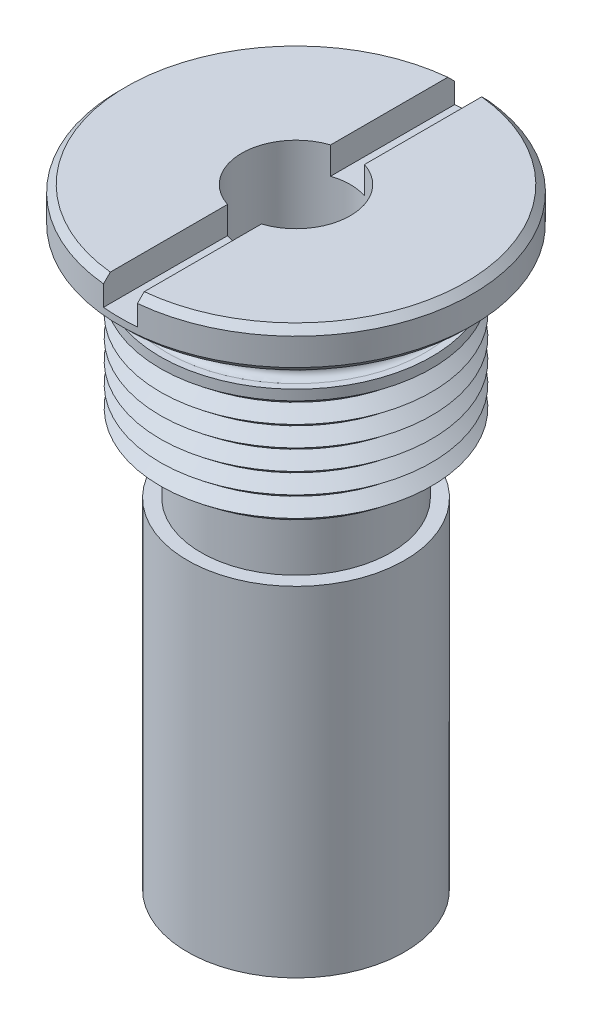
ISO-10303-21;
HEADER;
FILE_DESCRIPTION(('STEP AP214'),'2;1');
FILE_NAME('part.step','',(''),(''),'','','');
FILE_SCHEMA(('AUTOMOTIVE_DESIGN { 1 0 10303 214 1 1 1 1 }'));
ENDSEC;
DATA;
#1=APPLICATION_CONTEXT('core data for automotive mechanical design processes');
#2=APPLICATION_PROTOCOL_DEFINITION('international standard','automotive_design',2000,#1);
#3=PRODUCT_CONTEXT('',#1,'mechanical');
#4=PRODUCT('Part','Part','',(#3));
#5=PRODUCT_RELATED_PRODUCT_CATEGORY('part','',(#4));
#6=PRODUCT_DEFINITION_FORMATION('','',#4);
#7=PRODUCT_DEFINITION_CONTEXT('part definition',#1,'design');
#8=PRODUCT_DEFINITION('design','',#6,#7);
#9=PRODUCT_DEFINITION_SHAPE('','',#8);
#10=(LENGTH_UNIT() NAMED_UNIT(*) SI_UNIT(.MILLI.,.METRE.));
#11=(NAMED_UNIT(*) PLANE_ANGLE_UNIT() SI_UNIT($,.RADIAN.));
#12=(NAMED_UNIT(*) SI_UNIT($,.STERADIAN.) SOLID_ANGLE_UNIT());
#13=UNCERTAINTY_MEASURE_WITH_UNIT(LENGTH_MEASURE(1.E-05),#10,'distance_accuracy_value','');
#14=(GEOMETRIC_REPRESENTATION_CONTEXT(3) GLOBAL_UNCERTAINTY_ASSIGNED_CONTEXT((#13)) GLOBAL_UNIT_ASSIGNED_CONTEXT((#10,
#11,#12)) REPRESENTATION_CONTEXT('',''));
#15=CARTESIAN_POINT('',(0.,0.,0.));
#16=DIRECTION('',(0.,0.,1.));
#17=DIRECTION('',(1.,0.,0.));
#18=AXIS2_PLACEMENT_3D('',#15,#16,#17);
#19=CARTESIAN_POINT('',(0.,0.,0.));
#20=DIRECTION('',(0.,-1.,0.));
#21=DIRECTION('',(0.,0.,-1.));
#22=AXIS2_PLACEMENT_3D('',#19,#20,#21);
#23=CYLINDRICAL_SURFACE('',#22,6.);
#24=CARTESIAN_POINT('',(0.,0.,0.));
#25=DIRECTION('',(0.,-1.,0.));
#26=DIRECTION('',(0.,0.,-1.));
#27=AXIS2_PLACEMENT_3D('',#24,#25,#26);
#28=CIRCLE('',#27,6.);
#29=CARTESIAN_POINT('',(0.,0.,-6.));
#30=VERTEX_POINT('',#29);
#31=EDGE_CURVE('P0_E10',#30,#30,#28,.T.);
#32=ORIENTED_EDGE('',*,*,#31,.T.);
#33=EDGE_LOOP('',(#32));
#34=FACE_BOUND('',#33,.T.);
#35=CARTESIAN_POINT('',(0.,2.,0.));
#36=DIRECTION('',(0.,-1.,0.));
#37=DIRECTION('',(0.,0.,-1.));
#38=AXIS2_PLACEMENT_3D('',#35,#36,#37);
#39=CIRCLE('',#38,6.);
#40=CARTESIAN_POINT('',(0.,2.,-6.));
#41=VERTEX_POINT('',#40);
#42=EDGE_CURVE('P0_E36',#41,#41,#39,.T.);
#43=ORIENTED_EDGE('',*,*,#42,.F.);
#44=EDGE_LOOP('',(#43));
#45=FACE_BOUND('',#44,.T.);
#46=ADVANCED_FACE('P0_F14',(#34,#45),#23,.F.);
#47=CARTESIAN_POINT('',(6.,0.,0.));
#48=DIRECTION('',(0.,-1.,0.));
#49=DIRECTION('',(0.,0.,-1.));
#50=AXIS2_PLACEMENT_3D('',#47,#48,#49);
#51=PLANE('',#50);
#52=CARTESIAN_POINT('',(0.,0.,0.));
#53=DIRECTION('',(0.,-1.,0.));
#54=DIRECTION('',(0.,0.,-1.));
#55=AXIS2_PLACEMENT_3D('',#52,#53,#54);
#56=CIRCLE('',#55,8.);
#57=CARTESIAN_POINT('',(0.,0.,-8.));
#58=VERTEX_POINT('',#57);
#59=EDGE_CURVE('P0_E20',#58,#58,#56,.T.);
#60=ORIENTED_EDGE('',*,*,#59,.T.);
#61=EDGE_LOOP('',(#60));
#62=FACE_BOUND('',#61,.T.);
#63=ORIENTED_EDGE('',*,*,#31,.F.);
#64=EDGE_LOOP('',(#63));
#65=FACE_BOUND('',#64,.T.);
#66=ADVANCED_FACE('P0_F44',(#62,#65),#51,.T.);
#67=CARTESIAN_POINT('',(0.,0.,0.));
#68=DIRECTION('',(0.,-1.,0.));
#69=DIRECTION('',(0.,0.,-1.));
#70=AXIS2_PLACEMENT_3D('',#67,#68,#69);
#71=CYLINDRICAL_SURFACE('',#70,8.);
#72=CARTESIAN_POINT('',(0.,25.,0.));
#73=DIRECTION('',(0.,-1.,0.));
#74=DIRECTION('',(0.,0.,-1.));
#75=AXIS2_PLACEMENT_3D('',#72,#73,#74);
#76=CIRCLE('',#75,8.);
#77=CARTESIAN_POINT('',(0.,25.,-8.));
#78=VERTEX_POINT('',#77);
#79=EDGE_CURVE('P0_E24',#78,#78,#76,.T.);
#80=ORIENTED_EDGE('',*,*,#79,.T.);
#81=EDGE_LOOP('',(#80));
#82=FACE_BOUND('',#81,.T.);
#83=ORIENTED_EDGE('',*,*,#59,.F.);
#84=EDGE_LOOP('',(#83));
#85=FACE_BOUND('',#84,.T.);
#86=ADVANCED_FACE('P0_F49',(#82,#85),#71,.T.);
#87=CARTESIAN_POINT('',(8.,25.,0.));
#88=DIRECTION('',(0.,1.,0.));
#89=DIRECTION('',(0.,0.,1.));
#90=AXIS2_PLACEMENT_3D('',#87,#88,#89);
#91=PLANE('',#90);
#92=CARTESIAN_POINT('',(0.,25.,0.));
#93=DIRECTION('',(0.,-1.,0.));
#94=DIRECTION('',(0.,0.,-1.));
#95=AXIS2_PLACEMENT_3D('',#92,#93,#94);
#96=CIRCLE('',#95,7.);
#97=CARTESIAN_POINT('',(0.,25.,-7.));
#98=VERTEX_POINT('',#97);
#99=EDGE_CURVE('P0_E28',#98,#98,#96,.T.);
#100=ORIENTED_EDGE('',*,*,#99,.T.);
#101=EDGE_LOOP('',(#100));
#102=FACE_BOUND('',#101,.T.);
#103=ORIENTED_EDGE('',*,*,#79,.F.);
#104=EDGE_LOOP('',(#103));
#105=FACE_BOUND('',#104,.T.);
#106=ADVANCED_FACE('P0_F53',(#102,#105),#91,.T.);
#107=CARTESIAN_POINT('',(0.,0.,0.));
#108=DIRECTION('',(0.,-1.,0.));
#109=DIRECTION('',(0.,0.,-1.));
#110=AXIS2_PLACEMENT_3D('',#107,#108,#109);
#111=CYLINDRICAL_SURFACE('',#110,7.);
#112=CARTESIAN_POINT('',(0.,2.,0.));
#113=DIRECTION('',(0.,-1.,0.));
#114=DIRECTION('',(0.,0.,-1.));
#115=AXIS2_PLACEMENT_3D('',#112,#113,#114);
#116=CIRCLE('',#115,7.);
#117=CARTESIAN_POINT('',(0.,2.,-7.));
#118=VERTEX_POINT('',#117);
#119=EDGE_CURVE('P0_E33',#118,#118,#116,.T.);
#120=ORIENTED_EDGE('',*,*,#119,.T.);
#121=EDGE_LOOP('',(#120));
#122=FACE_BOUND('',#121,.T.);
#123=ORIENTED_EDGE('',*,*,#99,.F.);
#124=EDGE_LOOP('',(#123));
#125=FACE_BOUND('',#124,.T.);
#126=ADVANCED_FACE('P0_F60',(#122,#125),#111,.F.);
#127=CARTESIAN_POINT('',(7.,2.,0.));
#128=DIRECTION('',(0.,1.,0.));
#129=DIRECTION('',(0.,0.,1.));
#130=AXIS2_PLACEMENT_3D('',#127,#128,#129);
#131=PLANE('',#130);
#132=ORIENTED_EDGE('',*,*,#42,.T.);
#133=EDGE_LOOP('',(#132));
#134=FACE_BOUND('',#133,.T.);
#135=ORIENTED_EDGE('',*,*,#119,.F.);
#136=EDGE_LOOP('',(#135));
#137=FACE_BOUND('',#136,.T.);
#138=ADVANCED_FACE('P0_F40',(#134,#137),#131,.T.);
#139=CLOSED_SHELL('',(#46,#66,#86,#106,#126,#138));
#140=MANIFOLD_SOLID_BREP('P0_B1',#139);
#141=CARTESIAN_POINT('',(0.,0.,0.));
#142=DIRECTION('',(0.,-1.,0.));
#143=DIRECTION('',(0.,0.,-1.));
#144=AXIS2_PLACEMENT_3D('',#141,#142,#143);
#145=CYLINDRICAL_SURFACE('',#144,3.);
#146=CARTESIAN_POINT('',(-2.22377190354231,27.5,2.01366296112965));
#147=CARTESIAN_POINT('',(-2.22377168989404,27.4443233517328,2.01366387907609));
#148=CARTESIAN_POINT('',(-2.2206378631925,27.3886379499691,2.01714052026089));
#149=CARTESIAN_POINT('',(-2.2080831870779,27.2788222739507,2.03087502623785));
#150=CARTESIAN_POINT('',(-2.19866069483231,27.2246924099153,2.0411346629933));
#151=CARTESIAN_POINT('',(-2.17348413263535,27.1195162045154,2.0679223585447));
#152=CARTESIAN_POINT('',(-2.15772756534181,27.0684710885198,2.08445288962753));
#153=CARTESIAN_POINT('',(-2.11986325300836,26.9709864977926,2.12294735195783));
#154=CARTESIAN_POINT('',(-2.09775583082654,26.9245467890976,2.14491100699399));
#155=CARTESIAN_POINT('',(-2.04756229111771,26.8382260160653,2.19286929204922));
#156=CARTESIAN_POINT('',(-2.01955078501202,26.7982732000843,2.21881260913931));
#157=CARTESIAN_POINT('',(-1.95763982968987,26.7255716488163,2.27362045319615));
#158=CARTESIAN_POINT('',(-1.92374176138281,26.6928212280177,2.30248429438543));
#159=CARTESIAN_POINT('',(-1.85214158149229,26.636909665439,2.36042350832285));
#160=CARTESIAN_POINT('',(-1.81466249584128,26.6134000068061,2.38943770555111));
#161=CARTESIAN_POINT('',(-1.73556937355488,26.5749107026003,2.44748835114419));
#162=CARTESIAN_POINT('',(-1.69395695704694,26.559927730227,2.47652478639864));
#163=CARTESIAN_POINT('',(-1.61012119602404,26.5396482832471,2.5317758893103));
#164=CARTESIAN_POINT('',(-1.56806088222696,26.5338589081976,2.55805765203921));
#165=CARTESIAN_POINT('',(-1.48244074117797,26.5306062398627,2.60860856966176));
#166=CARTESIAN_POINT('',(-1.43888122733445,26.5331412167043,2.63287814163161));
#167=CARTESIAN_POINT('',(-1.35291425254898,26.5462413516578,2.67804268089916));
#168=CARTESIAN_POINT('',(-1.31051110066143,26.5565651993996,2.69901660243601));
#169=CARTESIAN_POINT('',(-1.22683779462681,26.5846092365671,2.73806538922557));
#170=CARTESIAN_POINT('',(-1.18556768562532,26.6023297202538,2.75614013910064));
#171=CARTESIAN_POINT('',(-1.10471969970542,26.6449629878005,2.78954145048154));
#172=CARTESIAN_POINT('',(-1.06518185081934,26.6699914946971,2.80481679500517));
#173=CARTESIAN_POINT('',(-0.989720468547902,26.7263633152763,2.83232578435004));
#174=CARTESIAN_POINT('',(-0.953797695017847,26.7577079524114,2.84455879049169));
#175=CARTESIAN_POINT('',(-0.884912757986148,26.8275416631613,2.86675867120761));
#176=CARTESIAN_POINT('',(-0.852185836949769,26.8663080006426,2.87658303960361));
#177=CARTESIAN_POINT('',(-0.792795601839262,26.9487644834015,2.8935154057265));
#178=CARTESIAN_POINT('',(-0.766133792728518,26.9924558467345,2.90062272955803));
#179=CARTESIAN_POINT('',(-0.718459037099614,27.0859205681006,2.9128087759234));
#180=CARTESIAN_POINT('',(-0.697798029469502,27.135889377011,2.9177673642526));
#181=CARTESIAN_POINT('',(-0.664630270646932,27.2386246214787,2.92550133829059));
#182=CARTESIAN_POINT('',(-0.652124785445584,27.291391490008,2.92827638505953));
#183=CARTESIAN_POINT('',(-0.635419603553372,27.3997691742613,2.93194797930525));
#184=CARTESIAN_POINT('',(-0.631455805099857,27.4554183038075,2.93279121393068));
#185=CARTESIAN_POINT('',(-0.632658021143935,27.566615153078,2.93253198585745));
#186=CARTESIAN_POINT('',(-0.637824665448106,27.6221628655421,2.93142938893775));
#187=CARTESIAN_POINT('',(-0.657189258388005,27.7319546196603,2.92714884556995));
#188=CARTESIAN_POINT('',(-0.671445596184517,27.7861878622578,2.92395747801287));
#189=CARTESIAN_POINT('',(-0.708589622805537,27.8914139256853,2.91517797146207));
#190=CARTESIAN_POINT('',(-0.731477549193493,27.942406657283,2.90958976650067));
#191=CARTESIAN_POINT('',(-0.784966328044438,28.0393231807,2.89561462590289));
#192=CARTESIAN_POINT('',(-0.815516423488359,28.0852775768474,2.88724599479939));
#193=CARTESIAN_POINT('',(-0.883388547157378,28.17106923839,2.86720636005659));
#194=CARTESIAN_POINT('',(-0.92070972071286,28.2109072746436,2.85553577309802));
#195=CARTESIAN_POINT('',(-0.999644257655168,28.282074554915,2.82885006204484));
#196=CARTESIAN_POINT('',(-1.04109988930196,28.3136188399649,2.81394290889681));
#197=CARTESIAN_POINT('',(-1.12771016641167,28.3685860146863,2.78036338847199));
#198=CARTESIAN_POINT('',(-1.17286345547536,28.3920118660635,2.76169239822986));
#199=CARTESIAN_POINT('',(-1.26271846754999,28.4288371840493,2.72173245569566));
#200=CARTESIAN_POINT('',(-1.30731354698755,28.4427086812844,2.70063864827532));
#201=CARTESIAN_POINT('',(-1.39682029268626,28.4618800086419,2.65544762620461));
#202=CARTESIAN_POINT('',(-1.44173185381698,28.4671825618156,2.63135136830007));
#203=CARTESIAN_POINT('',(-1.52832638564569,28.468977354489,2.58197380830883));
#204=CARTESIAN_POINT('',(-1.57006252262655,28.4658665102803,2.55679917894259));
#205=CARTESIAN_POINT('',(-1.65130470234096,28.4517846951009,2.50509702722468));
#206=CARTESIAN_POINT('',(-1.69081089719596,28.4408142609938,2.47856959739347));
#207=CARTESIAN_POINT('',(-1.76643645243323,28.4114604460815,2.4252494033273));
#208=CARTESIAN_POINT('',(-1.80257159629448,28.3931139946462,2.3984586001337));
#209=CARTESIAN_POINT('',(-1.87096696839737,28.3495905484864,2.34549696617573));
#210=CARTESIAN_POINT('',(-1.90322666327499,28.3244126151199,2.31932622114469));
#211=CARTESIAN_POINT('',(-1.96453181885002,28.2668893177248,2.26766044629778));
#212=CARTESIAN_POINT('',(-1.9934094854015,28.2343088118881,2.24222844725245));
#213=CARTESIAN_POINT('',(-2.04617286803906,28.1635130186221,2.19418614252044));
#214=CARTESIAN_POINT('',(-2.07005712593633,28.1252960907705,2.17157666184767));
#215=CARTESIAN_POINT('',(-2.1138493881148,28.04203815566,2.12899645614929));
#216=CARTESIAN_POINT('',(-2.13347149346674,27.9967394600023,2.1092353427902));
#217=CARTESIAN_POINT('',(-2.16696912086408,27.9022570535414,2.07480702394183));
#218=CARTESIAN_POINT('',(-2.18084465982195,27.8530733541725,2.06013980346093));
#219=CARTESIAN_POINT('',(-2.20251032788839,27.7537833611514,2.0369566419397));
#220=CARTESIAN_POINT('',(-2.21048595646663,27.7037609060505,2.02825389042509));
#221=CARTESIAN_POINT('',(-2.22111704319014,27.6024948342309,2.01660641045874));
#222=CARTESIAN_POINT('',(-2.22377210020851,27.5512511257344,2.01366211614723));
#223=CARTESIAN_POINT('',(-2.22377190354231,27.5,2.01366296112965));
#224=B_SPLINE_CURVE_WITH_KNOTS('',3,(#146,#147,#148,#149,#150,#151,#152,#153,#154,#155,#156,
#157,#158,#159,#160,#161,#162,#163,#164,#165,#166,#167,#168,#169,#170,#171,#172,#173,#174,#175,
#176,#177,#178,#179,#180,#181,#182,#183,#184,#185,#186,#187,#188,#189,#190,#191,#192,#193,#194,
#195,#196,#197,#198,#199,#200,#201,#202,#203,#204,#205,#206,#207,#208,#209,#210,#211,#212,#213,
#214,#215,#216,#217,#218,#219,#220,#221,#222,#223),.UNSPECIFIED.,.T.,.F.,(4,2,2,2,2,2,2,2,2,2,2,
2,2,2,2,2,2,2,2,2,2,2,2,2,2,2,2,2,2,2,2,2,2,2,2,2,2,2,4),(0.,0.166849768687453,
0.333743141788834,0.500702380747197,0.667653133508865,0.832608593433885,0.997525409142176,
1.155430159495,1.31327325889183,1.46232750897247,1.6113507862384,1.75593754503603,
1.90053005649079,2.04754939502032,2.19459957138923,2.34894389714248,2.50332647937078,
2.66548088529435,2.82766045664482,2.99426446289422,3.16087996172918,3.32857667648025,
3.49627800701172,3.66289648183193,3.82949394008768,3.99121187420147,4.15287074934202,
4.3058234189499,4.45872747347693,4.60454534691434,4.75035326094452,4.89544007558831,
5.04054683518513,5.1911438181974,5.34178471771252,5.50059546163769,5.6594057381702,
5.81298168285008,5.96656920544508),.UNSPECIFIED.);
#225=CARTESIAN_POINT('',(-2.22377190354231,27.5,2.01366296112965));
#226=VERTEX_POINT('',#225);
#227=EDGE_CURVE('P1_E148',#226,#226,#224,.T.);
#228=ORIENTED_EDGE('',*,*,#227,.T.);
#229=EDGE_LOOP('',(#228));
#230=FACE_BOUND('',#229,.T.);
#231=CARTESIAN_POINT('',(0.,31.,0.));
#232=DIRECTION('',(0.,-1.,0.));
#233=DIRECTION('',(0.,0.,-1.));
#234=AXIS2_PLACEMENT_3D('',#231,#232,#233);
#235=CIRCLE('',#234,3.);
#236=CARTESIAN_POINT('',(0.,31.,-3.));
#237=VERTEX_POINT('',#236);
#238=EDGE_CURVE('P1_E253',#237,#237,#235,.T.);
#239=ORIENTED_EDGE('',*,*,#238,.F.);
#240=EDGE_LOOP('',(#239));
#241=FACE_BOUND('',#240,.T.);
#242=CARTESIAN_POINT('',(0.,0.,0.));
#243=DIRECTION('',(0.,-1.,0.));
#244=DIRECTION('',(0.,0.,-1.));
#245=AXIS2_PLACEMENT_3D('',#242,#243,#244);
#246=CIRCLE('',#245,3.);
#247=CARTESIAN_POINT('',(0.,0.,-3.));
#248=VERTEX_POINT('',#247);
#249=EDGE_CURVE('P1_E256',#248,#248,#246,.T.);
#250=ORIENTED_EDGE('',*,*,#249,.T.);
#251=EDGE_LOOP('',(#250));
#252=FACE_BOUND('',#251,.T.);
#253=CARTESIAN_POINT('',(2.8557692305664,27.5,0.91901148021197));
#254=CARTESIAN_POINT('',(2.85576991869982,27.4443233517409,0.919010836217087));
#255=CARTESIAN_POINT('',(2.85721386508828,27.3886379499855,0.914558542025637));
#256=CARTESIAN_POINT('',(2.86283095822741,27.2788222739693,0.896818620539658));
#257=CARTESIAN_POINT('',(2.86700481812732,27.224692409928,0.883528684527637));
#258=CARTESIAN_POINT('',(2.87761536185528,27.1195162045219,0.848331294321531));
#259=CARTESIAN_POINT('',(2.88405293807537,27.0684710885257,0.826420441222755));
#260=CARTESIAN_POINT('',(2.89845796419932,26.970986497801,0.774381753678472));
#261=CARTESIAN_POINT('',(2.90642533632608,26.9245467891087,0.744254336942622));
#262=CARTESIAN_POINT('',(2.92286165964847,26.8382260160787,0.676806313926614));
#263=CARTESIAN_POINT('',(2.93132347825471,26.7982732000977,0.639575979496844));
#264=CARTESIAN_POINT('',(2.9478329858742,26.7255716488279,0.558555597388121));
#265=CARTESIAN_POINT('',(2.95588077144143,26.6928212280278,0.514767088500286));
#266=CARTESIAN_POINT('',(2.97025751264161,26.6369096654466,0.42378990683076));
#267=CARTESIAN_POINT('',(2.97664500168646,26.6134000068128,0.376824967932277));
#268=CARTESIAN_POINT('',(2.98737177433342,26.5749107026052,0.279302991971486));
#269=CARTESIAN_POINT('',(2.99171185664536,26.559927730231,0.228747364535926));
#270=CARTESIAN_POINT('',(2.997642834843,26.5396482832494,0.128517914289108));
#271=CARTESIAN_POINT('',(2.99937335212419,26.533858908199,0.0789517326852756));
#272=CARTESIAN_POINT('',(3.00034166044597,26.5306062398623,-0.0204729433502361));
#273=CARTESIAN_POINT('',(2.99957996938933,26.5331412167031,-0.0703313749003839));
#274=CARTESIAN_POINT('',(2.99571012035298,26.546241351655,-0.167363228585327));
#275=CARTESIAN_POINT('',(2.99267249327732,26.556565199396,-0.21457239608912));
#276=CARTESIAN_POINT('',(2.98465308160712,26.584609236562,-0.306559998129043));
#277=CARTESIAN_POINT('',(2.97967121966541,26.6023297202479,-0.351338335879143));
#278=CARTESIAN_POINT('',(2.96817361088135,26.6449629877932,-0.438055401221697));
#279=CARTESIAN_POINT('',(2.96163352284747,26.669991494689,-0.479933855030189));
#280=CARTESIAN_POINT('',(2.94772631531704,26.7263633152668,-0.559039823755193));
#281=CARTESIAN_POINT('',(2.94035902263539,26.7577079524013,-0.596266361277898));
#282=CARTESIAN_POINT('',(2.92514221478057,26.8275416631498,-0.667022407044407));
#283=CARTESIAN_POINT('',(2.91728690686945,26.8663080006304,-0.70027693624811));
#284=CARTESIAN_POINT('',(2.9022556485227,26.9487644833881,-0.760176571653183));
#285=CARTESIAN_POINT('',(2.89507986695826,26.9924558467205,-0.786820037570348));
#286=CARTESIAN_POINT('',(2.88179591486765,27.0859205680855,-0.834200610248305));
#287=CARTESIAN_POINT('',(2.87575967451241,27.1358893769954,-0.854572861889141));
#288=CARTESIAN_POINT('',(2.86587361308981,27.2386246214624,-0.887163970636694));
#289=CARTESIAN_POINT('',(2.86202413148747,27.2913914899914,-0.899381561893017));
#290=CARTESIAN_POINT('',(2.85685123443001,27.3997691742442,-0.915684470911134));
#291=CARTESIAN_POINT('',(2.85559959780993,27.4554183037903,-0.919538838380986));
#292=CARTESIAN_POINT('',(2.85597620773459,27.5666151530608,-0.918368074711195));
#293=CARTESIAN_POINT('',(2.85760465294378,27.6221628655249,-0.913342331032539));
#294=CARTESIAN_POINT('',(2.86357989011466,27.7319546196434,-0.894431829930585));
#295=CARTESIAN_POINT('',(2.8679442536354,27.7861878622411,-0.880489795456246));
#296=CARTESIAN_POINT('',(2.87891299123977,27.8914139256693,-0.843932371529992));
#297=CARTESIAN_POINT('',(2.88551742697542,27.9424066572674,-0.82131674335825));
#298=CARTESIAN_POINT('',(2.90015898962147,28.0393231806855,-0.768006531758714));
#299=CARTESIAN_POINT('',(2.9081865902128,28.0852775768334,-0.737365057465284));
#300=CARTESIAN_POINT('',(2.92476781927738,28.1710692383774,-0.668566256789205));
#301=CARTESIAN_POINT('',(2.93332138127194,28.2109072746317,-0.630409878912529));
#302=CARTESIAN_POINT('',(2.94967814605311,28.2820745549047,-0.548707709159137));
#303=CARTESIAN_POINT('',(2.95749598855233,28.3136188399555,-0.50535250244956));
#304=CARTESIAN_POINT('',(2.97172040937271,28.3685860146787,-0.413556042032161));
#305=CARTESIAN_POINT('',(2.97812750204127,28.3920118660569,-0.365116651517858));
#306=CARTESIAN_POINT('',(2.98844868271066,28.4288371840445,-0.267319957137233));
#307=CARTESIAN_POINT('',(2.99247844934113,28.4427086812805,-0.218152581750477));
#308=CARTESIAN_POINT('',(2.99809524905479,28.4618800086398,-0.118041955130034));
#309=CARTESIAN_POINT('',(2.99968305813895,28.4671825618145,-0.0670992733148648));
#310=CARTESIAN_POINT('',(3.00021810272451,28.4689773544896,0.0325825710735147));
#311=CARTESIAN_POINT('',(2.99928430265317,28.4658665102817,0.0813144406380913));
#312=CARTESIAN_POINT('',(2.9951300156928,28.4517846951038,0.177523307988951));
#313=CARTESIAN_POINT('',(2.99190968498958,28.4408142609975,0.225000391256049));
#314=CARTESIAN_POINT('',(2.98354582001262,28.4114604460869,0.317154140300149));
#315=CARTESIAN_POINT('',(2.97841187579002,28.3931139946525,0.361843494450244));
#316=CARTESIAN_POINT('',(2.96674344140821,28.3495905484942,0.447556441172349));
#317=CARTESIAN_POINT('',(2.96020875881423,28.3244126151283,0.488579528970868));
#318=CARTESIAN_POINT('',(2.94611746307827,28.2668893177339,0.567504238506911));
#319=CARTESIAN_POINT('',(2.93853153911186,28.2343088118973,0.605229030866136));
#320=CARTESIAN_POINT('',(2.92330737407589,28.1635130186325,0.674944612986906));
#321=CARTESIAN_POINT('',(2.91566911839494,28.1252960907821,0.706933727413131));
#322=CARTESIAN_POINT('',(2.90068970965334,28.0420381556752,0.766149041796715));
#323=CARTESIAN_POINT('',(2.89338713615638,27.99673946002,0.793022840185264));
#324=CARTESIAN_POINT('',(2.88032015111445,27.9022570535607,0.839246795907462));
#325=CARTESIAN_POINT('',(2.87455573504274,27.8530733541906,0.858596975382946));
#326=CARTESIAN_POINT('',(2.8653113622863,27.7537833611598,0.888951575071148));
#327=CARTESIAN_POINT('',(2.86176237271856,27.70376090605,0.900210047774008));
#328=CARTESIAN_POINT('',(2.85699090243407,27.6024948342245,0.915240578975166));
#329=CARTESIAN_POINT('',(2.85576859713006,27.5512511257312,0.919012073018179));
#330=CARTESIAN_POINT('',(2.8557692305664,27.5,0.91901148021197));
#331=B_SPLINE_CURVE_WITH_KNOTS('',3,(#253,#254,#255,#256,#257,#258,#259,#260,#261,#262,#263,
#264,#265,#266,#267,#268,#269,#270,#271,#272,#273,#274,#275,#276,#277,#278,#279,#280,#281,#282,
#283,#284,#285,#286,#287,#288,#289,#290,#291,#292,#293,#294,#295,#296,#297,#298,#299,#300,#301,
#302,#303,#304,#305,#306,#307,#308,#309,#310,#311,#312,#313,#314,#315,#316,#317,#318,#319,#320,
#321,#322,#323,#324,#325,#326,#327,#328,#329,#330),.UNSPECIFIED.,.T.,.F.,(4,2,2,2,2,2,2,2,2,2,2,
2,2,2,2,2,2,2,2,2,2,2,2,2,2,2,2,2,2,2,2,2,2,2,2,2,2,2,4),(0.,0.166849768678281,
0.333743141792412,0.500702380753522,0.667653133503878,0.832608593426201,0.99752540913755,
1.15543015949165,1.31327325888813,1.46232750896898,1.61135078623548,1.75593754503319,
1.90053005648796,2.04754939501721,2.19459957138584,2.34894389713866,2.50332647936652,
2.66548088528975,2.82766045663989,2.99426446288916,3.160879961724,3.32857667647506,
3.49627800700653,3.66289648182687,3.82949394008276,3.99121187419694,4.15287074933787,
4.30582341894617,4.45872747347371,4.60454534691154,4.75035326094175,4.89544007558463,
5.04054683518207,5.19114381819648,5.34178471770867,5.50059546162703,5.65940573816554,
5.81298168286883,5.96656920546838),.UNSPECIFIED.);
#332=CARTESIAN_POINT('',(2.8557692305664,27.5,0.91901148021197));
#333=VERTEX_POINT('',#332);
#334=EDGE_CURVE('P1_E141',#333,#333,#331,.T.);
#335=ORIENTED_EDGE('',*,*,#334,.T.);
#336=EDGE_LOOP('',(#335));
#337=FACE_BOUND('',#336,.T.);
#338=CARTESIAN_POINT('',(-2.22377190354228,27.5,-2.01366296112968));
#339=CARTESIAN_POINT('',(-2.22377168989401,27.5556766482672,-2.01366387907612));
#340=CARTESIAN_POINT('',(-2.22063786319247,27.6113620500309,-2.01714052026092));
#341=CARTESIAN_POINT('',(-2.20808318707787,27.7211777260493,-2.03087502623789));
#342=CARTESIAN_POINT('',(-2.19866069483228,27.7753075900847,-2.04113466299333));
#343=CARTESIAN_POINT('',(-2.17348413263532,27.8804837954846,-2.06792235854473));
#344=CARTESIAN_POINT('',(-2.15772756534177,27.9315289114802,-2.08445288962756));
#345=CARTESIAN_POINT('',(-2.11986325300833,28.0290135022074,-2.12294735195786));
#346=CARTESIAN_POINT('',(-2.09775583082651,28.0754532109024,-2.14491100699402));
#347=CARTESIAN_POINT('',(-2.04756229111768,28.1617739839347,-2.19286929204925));
#348=CARTESIAN_POINT('',(-2.01955078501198,28.2017267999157,-2.21881260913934));
#349=CARTESIAN_POINT('',(-1.95763982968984,28.2744283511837,-2.27362045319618));
#350=CARTESIAN_POINT('',(-1.92374176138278,28.3071787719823,-2.30248429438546));
#351=CARTESIAN_POINT('',(-1.85214158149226,28.363090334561,-2.36042350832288));
#352=CARTESIAN_POINT('',(-1.81466249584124,28.3865999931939,-2.38943770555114));
#353=CARTESIAN_POINT('',(-1.73556937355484,28.4250892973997,-2.44748835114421));
#354=CARTESIAN_POINT('',(-1.6939569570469,28.440072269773,-2.47652478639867));
#355=CARTESIAN_POINT('',(-1.610121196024,28.4603517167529,-2.53177588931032));
#356=CARTESIAN_POINT('',(-1.56806088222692,28.4661410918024,-2.55805765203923));
#357=CARTESIAN_POINT('',(-1.48244074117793,28.4693937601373,-2.60860856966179));
#358=CARTESIAN_POINT('',(-1.43888122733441,28.4668587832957,-2.63287814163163));
#359=CARTESIAN_POINT('',(-1.35291425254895,28.4537586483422,-2.67804268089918));
#360=CARTESIAN_POINT('',(-1.31051110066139,28.4434348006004,-2.69901660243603));
#361=CARTESIAN_POINT('',(-1.22683779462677,28.4153907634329,-2.73806538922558));
#362=CARTESIAN_POINT('',(-1.18556768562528,28.3976702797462,-2.75614013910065));
#363=CARTESIAN_POINT('',(-1.10471969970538,28.3550370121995,-2.78954145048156));
#364=CARTESIAN_POINT('',(-1.0651818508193,28.3300085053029,-2.80481679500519));
#365=CARTESIAN_POINT('',(-0.989720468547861,28.2736366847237,-2.83232578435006));
#366=CARTESIAN_POINT('',(-0.953797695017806,28.2422920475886,-2.8445587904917));
#367=CARTESIAN_POINT('',(-0.884912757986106,28.1724583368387,-2.86675867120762));
#368=CARTESIAN_POINT('',(-0.852185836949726,28.1336919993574,-2.87658303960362));
#369=CARTESIAN_POINT('',(-0.79279560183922,28.0512355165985,-2.89351540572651));
#370=CARTESIAN_POINT('',(-0.766133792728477,28.0075441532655,-2.90062272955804));
#371=CARTESIAN_POINT('',(-0.718459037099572,27.9140794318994,-2.91280877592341));
#372=CARTESIAN_POINT('',(-0.697798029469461,27.864110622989,-2.91776736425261));
#373=CARTESIAN_POINT('',(-0.66463027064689,27.7613753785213,-2.9255013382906));
#374=CARTESIAN_POINT('',(-0.652124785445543,27.708608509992,-2.92827638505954));
#375=CARTESIAN_POINT('',(-0.63541960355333,27.6002308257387,-2.93194797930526));
#376=CARTESIAN_POINT('',(-0.631455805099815,27.5445816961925,-2.93279121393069));
#377=CARTESIAN_POINT('',(-0.632658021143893,27.433384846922,-2.93253198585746));
#378=CARTESIAN_POINT('',(-0.637824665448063,27.3778371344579,-2.93142938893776));
#379=CARTESIAN_POINT('',(-0.657189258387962,27.2680453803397,-2.92714884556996));
#380=CARTESIAN_POINT('',(-0.671445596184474,27.2138121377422,-2.92395747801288));
#381=CARTESIAN_POINT('',(-0.708589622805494,27.1085860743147,-2.91517797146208));
#382=CARTESIAN_POINT('',(-0.731477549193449,27.057593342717,-2.90958976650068));
#383=CARTESIAN_POINT('',(-0.784966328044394,26.9606768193,-2.8956146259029));
#384=CARTESIAN_POINT('',(-0.815516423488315,26.9147224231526,-2.8872459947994));
#385=CARTESIAN_POINT('',(-0.883388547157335,26.82893076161,-2.8672063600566));
#386=CARTESIAN_POINT('',(-0.920709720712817,26.7890927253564,-2.85553577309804));
#387=CARTESIAN_POINT('',(-0.999644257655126,26.717925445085,-2.82885006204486));
#388=CARTESIAN_POINT('',(-1.04109988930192,26.6863811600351,-2.81394290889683));
#389=CARTESIAN_POINT('',(-1.12771016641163,26.6314139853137,-2.78036338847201));
#390=CARTESIAN_POINT('',(-1.17286345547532,26.6079881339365,-2.76169239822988));
#391=CARTESIAN_POINT('',(-1.26271846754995,26.5711628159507,-2.72173245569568));
#392=CARTESIAN_POINT('',(-1.30731354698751,26.5572913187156,-2.70063864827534));
#393=CARTESIAN_POINT('',(-1.39682029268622,26.5381199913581,-2.65544762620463));
#394=CARTESIAN_POINT('',(-1.44173185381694,26.5328174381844,-2.63135136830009));
#395=CARTESIAN_POINT('',(-1.52832638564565,26.531022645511,-2.58197380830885));
#396=CARTESIAN_POINT('',(-1.57006252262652,26.5341334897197,-2.55679917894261));
#397=CARTESIAN_POINT('',(-1.65130470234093,26.5482153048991,-2.50509702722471));
#398=CARTESIAN_POINT('',(-1.69081089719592,26.5591857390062,-2.47856959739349));
#399=CARTESIAN_POINT('',(-1.76643645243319,26.5885395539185,-2.42524940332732));
#400=CARTESIAN_POINT('',(-1.80257159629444,26.6068860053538,-2.39845860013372));
#401=CARTESIAN_POINT('',(-1.87096696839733,26.6504094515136,-2.34549696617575));
#402=CARTESIAN_POINT('',(-1.90322666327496,26.6755873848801,-2.31932622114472));
#403=CARTESIAN_POINT('',(-1.96453181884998,26.7331106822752,-2.26766044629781));
#404=CARTESIAN_POINT('',(-1.99340948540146,26.7656911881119,-2.24222844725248));
#405=CARTESIAN_POINT('',(-2.04617286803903,26.8364869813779,-2.19418614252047));
#406=CARTESIAN_POINT('',(-2.0700571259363,26.8747039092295,-2.1715766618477));
#407=CARTESIAN_POINT('',(-2.11384938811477,26.95796184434,-2.12899645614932));
#408=CARTESIAN_POINT('',(-2.13347149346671,27.0032605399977,-2.10923534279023));
#409=CARTESIAN_POINT('',(-2.16696912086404,27.0977429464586,-2.07480702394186));
#410=CARTESIAN_POINT('',(-2.18084465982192,27.1469266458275,-2.06013980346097));
#411=CARTESIAN_POINT('',(-2.20251032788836,27.2462166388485,-2.03695664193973));
#412=CARTESIAN_POINT('',(-2.21048595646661,27.2962390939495,-2.02825389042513));
#413=CARTESIAN_POINT('',(-2.22111704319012,27.3975051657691,-2.01660641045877));
#414=CARTESIAN_POINT('',(-2.22377210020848,27.4487488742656,-2.01366211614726));
#415=CARTESIAN_POINT('',(-2.22377190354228,27.5,-2.01366296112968));
#416=B_SPLINE_CURVE_WITH_KNOTS('',3,(#338,#339,#340,#341,#342,#343,#344,#345,#346,#347,#348,
#349,#350,#351,#352,#353,#354,#355,#356,#357,#358,#359,#360,#361,#362,#363,#364,#365,#366,#367,
#368,#369,#370,#371,#372,#373,#374,#375,#376,#377,#378,#379,#380,#381,#382,#383,#384,#385,#386,
#387,#388,#389,#390,#391,#392,#393,#394,#395,#396,#397,#398,#399,#400,#401,#402,#403,#404,#405,
#406,#407,#408,#409,#410,#411,#412,#413,#414,#415),.UNSPECIFIED.,.T.,.F.,(4,2,2,2,2,2,2,2,2,2,2,
2,2,2,2,2,2,2,2,2,2,2,2,2,2,2,2,2,2,2,2,2,2,2,2,2,2,2,4),(0.,0.166849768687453,
0.333743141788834,0.500702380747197,0.667653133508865,0.832608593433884,0.997525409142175,
1.155430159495,1.31327325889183,1.46232750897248,1.6113507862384,1.75593754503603,
1.90053005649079,2.04754939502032,2.19459957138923,2.34894389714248,2.50332647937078,
2.66548088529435,2.82766045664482,2.99426446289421,3.16087996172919,3.32857667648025,
3.49627800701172,3.66289648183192,3.82949394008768,3.99121187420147,4.15287074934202,
4.3058234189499,4.45872747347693,4.60454534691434,4.75035326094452,4.89544007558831,
5.04054683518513,5.19114381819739,5.34178471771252,5.50059546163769,5.6594057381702,
5.81298168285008,5.96656920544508),.UNSPECIFIED.);
#417=CARTESIAN_POINT('',(-2.22377190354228,27.5,-2.01366296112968));
#418=VERTEX_POINT('',#417);
#419=EDGE_CURVE('P1_E19',#418,#418,#416,.T.);
#420=ORIENTED_EDGE('',*,*,#419,.T.);
#421=EDGE_LOOP('',(#420));
#422=FACE_BOUND('',#421,.T.);
#423=ADVANCED_FACE('P1_F15',(#230,#241,#252,#337,#422),#145,.F.);
#424=CARTESIAN_POINT('',(12.5,45.,0.));
#425=DIRECTION('',(0.,1.,0.));
#426=DIRECTION('',(0.,0.,1.));
#427=AXIS2_PLACEMENT_3D('',#424,#425,#426);
#428=PLANE('',#427);
#429=DIRECTION('',(0.,0.,-1.));
#430=VECTOR('',#429,1.);
#431=CARTESIAN_POINT('',(1.25,45.,-13.));
#432=LINE('',#431,#430);
#433=CARTESIAN_POINT('',(1.25,45.,12.4373429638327));
#434=VERTEX_POINT('',#433);
#435=CARTESIAN_POINT('',(1.25,45.,3.79967103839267));
#436=VERTEX_POINT('',#435);
#437=EDGE_CURVE('P1_E100',#434,#436,#432,.T.);
#438=ORIENTED_EDGE('',*,*,#437,.F.);
#439=CARTESIAN_POINT('',(0.,45.,0.));
#440=DIRECTION('',(0.,-1.,0.));
#441=DIRECTION('',(0.,0.,-1.));
#442=AXIS2_PLACEMENT_3D('',#439,#440,#441);
#443=CIRCLE('',#442,12.5);
#444=CARTESIAN_POINT('',(1.25,45.,-12.4373429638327));
#445=VERTEX_POINT('',#444);
#446=EDGE_CURVE('P1_E116',#445,#434,#443,.T.);
#447=ORIENTED_EDGE('',*,*,#446,.F.);
#448=CARTESIAN_POINT('',(1.25,45.,-3.79967103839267));
#449=VERTEX_POINT('',#448);
#450=EDGE_CURVE('P1_E120',#449,#445,#432,.T.);
#451=ORIENTED_EDGE('',*,*,#450,.F.);
#452=CARTESIAN_POINT('',(0.,45.,0.));
#453=DIRECTION('',(0.,-1.,0.));
#454=DIRECTION('',(0.,0.,-1.));
#455=AXIS2_PLACEMENT_3D('',#452,#453,#454);
#456=CIRCLE('',#455,4.);
#457=EDGE_CURVE('P1_E118',#449,#436,#456,.T.);
#458=ORIENTED_EDGE('',*,*,#457,.T.);
#459=EDGE_LOOP('',(#438,#447,#451,#458));
#460=FACE_BOUND('',#459,.T.);
#461=ADVANCED_FACE('P1_F114',(#460),#428,.T.);
#462=CARTESIAN_POINT('',(0.,44.5,0.));
#463=DIRECTION('',(0.,-1.,0.));
#464=DIRECTION('',(0.,0.,-1.));
#465=AXIS2_PLACEMENT_3D('',#462,#463,#464);
#466=CONICAL_SURFACE('',#465,13.,0.785398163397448);
#467=CARTESIAN_POINT('',(1.25,28.896915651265,28.5757578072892));
#468=CARTESIAN_POINT('',(1.25,29.8832162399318,27.5885064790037));
#469=CARTESIAN_POINT('',(1.25,30.8694751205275,26.6012134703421));
#470=CARTESIAN_POINT('',(1.25,32.8418592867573,24.6264862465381));
#471=CARTESIAN_POINT('',(1.25,33.8279845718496,23.6390520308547));
#472=CARTESIAN_POINT('',(1.25,35.800116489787,21.6639193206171));
#473=CARTESIAN_POINT('',(1.25,36.7861231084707,20.6762208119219));
#474=CARTESIAN_POINT('',(1.25,38.7578393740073,18.7005349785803));
#475=CARTESIAN_POINT('',(1.25,39.7435490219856,17.7125476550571));
#476=CARTESIAN_POINT('',(1.25,41.7154978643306,15.7351060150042));
#477=CARTESIAN_POINT('',(1.25,42.7017365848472,14.7456512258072));
#478=CARTESIAN_POINT('',(1.25,44.18046224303,13.2608274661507));
#479=CARTESIAN_POINT('',(1.25,44.673268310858,12.7657763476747));
#480=CARTESIAN_POINT('',(1.25,45.6585752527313,11.7753715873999));
#481=CARTESIAN_POINT('',(1.25,46.1510761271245,11.2800179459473));
#482=CARTESIAN_POINT('',(1.25,47.1356149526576,10.2888898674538));
#483=CARTESIAN_POINT('',(1.25,47.6276529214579,9.79311544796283));
#484=CARTESIAN_POINT('',(1.25,48.6110399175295,8.8008794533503));
#485=CARTESIAN_POINT('',(1.25,49.1023889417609,8.30441787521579));
#486=CARTESIAN_POINT('',(1.25,50.0839440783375,7.3103848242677));
#487=CARTESIAN_POINT('',(1.25,50.5741502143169,6.81281337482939));
#488=CARTESIAN_POINT('',(1.25,51.3078385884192,6.06486917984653));
#489=CARTESIAN_POINT('',(1.25,51.5521303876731,5.81529082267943));
#490=CARTESIAN_POINT('',(1.25,52.0399185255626,5.31535821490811));
#491=CARTESIAN_POINT('',(1.25,52.2834148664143,5.06500396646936));
#492=CARTESIAN_POINT('',(1.25,52.5926968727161,4.74546248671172));
#493=CARTESIAN_POINT('',(1.25,52.6590463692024,4.67682093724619));
#494=CARTESIAN_POINT('',(1.25,52.7916399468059,4.539435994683));
#495=CARTESIAN_POINT('',(1.25,52.857884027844,4.47069260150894));
#496=CARTESIAN_POINT('',(1.25,53.0564335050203,4.26429349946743));
#497=CARTESIAN_POINT('',(1.25,53.188559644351,4.12646524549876));
#498=CARTESIAN_POINT('',(1.25,53.4521900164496,3.85019233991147));
#499=CARTESIAN_POINT('',(1.25,53.5836941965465,3.71174763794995));
#500=CARTESIAN_POINT('',(1.25,53.8458365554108,3.43402066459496));
#501=CARTESIAN_POINT('',(1.25,53.9764746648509,3.29473832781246));
#502=CARTESIAN_POINT('',(1.25,54.2806166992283,2.96762355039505));
#503=CARTESIAN_POINT('',(1.25,54.4536386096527,2.77933955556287));
#504=CARTESIAN_POINT('',(1.25,54.710282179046,2.4943318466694));
#505=CARTESIAN_POINT('',(1.25,54.795342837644,2.39890552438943));
#506=CARTESIAN_POINT('',(1.25,54.9641217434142,2.20687470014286));
#507=CARTESIAN_POINT('',(1.25,55.0478400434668,2.11027024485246));
#508=CARTESIAN_POINT('',(1.25,55.190872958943,1.94189638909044));
#509=CARTESIAN_POINT('',(1.25,55.2506381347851,1.87051041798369));
#510=CARTESIAN_POINT('',(1.25,55.3688098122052,1.72660457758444));
#511=CARTESIAN_POINT('',(1.25,55.4272161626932,1.65408458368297));
#512=CARTESIAN_POINT('',(1.25,55.5422248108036,1.50746662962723));
#513=CARTESIAN_POINT('',(1.25,55.5988246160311,1.43336670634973));
#514=CARTESIAN_POINT('',(1.25,55.7093354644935,1.28319030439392));
#515=CARTESIAN_POINT('',(1.25,55.7632471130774,1.20711427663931));
#516=CARTESIAN_POINT('',(1.25,55.8493529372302,1.07868369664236));
#517=CARTESIAN_POINT('',(1.25,55.8826805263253,1.0270925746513));
#518=CARTESIAN_POINT('',(1.25,55.9470103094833,0.922486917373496));
#519=CARTESIAN_POINT('',(1.25,55.9780130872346,0.869472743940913));
#520=CARTESIAN_POINT('',(1.25,56.0368520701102,0.76179364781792));
#521=CARTESIAN_POINT('',(1.25,56.0646930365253,0.707131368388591));
#522=CARTESIAN_POINT('',(1.25,56.1161196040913,0.595871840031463));
#523=CARTESIAN_POINT('',(1.25,56.1397080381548,0.539275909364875));
#524=CARTESIAN_POINT('',(1.25,56.1867400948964,0.408392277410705));
#525=CARTESIAN_POINT('',(1.25,56.208441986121,0.333436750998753));
#526=CARTESIAN_POINT('',(1.25,56.2314736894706,0.219208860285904));
#527=CARTESIAN_POINT('',(1.25,56.2375624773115,0.180880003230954));
#528=CARTESIAN_POINT('',(1.25,56.2462769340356,0.103837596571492));
#529=CARTESIAN_POINT('',(1.25,56.2489042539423,0.0651242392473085));
#530=CARTESIAN_POINT('',(1.25,56.2505438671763,-0.0125909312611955));
#531=CARTESIAN_POINT('',(1.25,56.249536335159,-0.0515931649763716));
#532=CARTESIAN_POINT('',(1.25,56.2439251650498,-0.129335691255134));
#533=CARTESIAN_POINT('',(1.25,56.2393213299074,-0.168075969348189));
#534=CARTESIAN_POINT('',(1.25,56.2267665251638,-0.245095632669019));
#535=CARTESIAN_POINT('',(1.25,56.2188077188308,-0.283373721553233));
#536=CARTESIAN_POINT('',(1.25,56.1999362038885,-0.359185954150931));
#537=CARTESIAN_POINT('',(1.25,56.1890231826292,-0.39672001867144));
#538=CARTESIAN_POINT('',(1.25,56.1518284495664,-0.510169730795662));
#539=CARTESIAN_POINT('',(1.25,56.1214879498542,-0.58475517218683));
#540=CARTESIAN_POINT('',(1.25,56.0536035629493,-0.730580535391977));
#541=CARTESIAN_POINT('',(1.25,56.0160467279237,-0.801814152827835));
#542=CARTESIAN_POINT('',(1.25,55.9358152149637,-0.942073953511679));
#543=CARTESIAN_POINT('',(1.25,55.8931013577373,-1.01107744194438));
#544=CARTESIAN_POINT('',(1.25,55.8265625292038,-1.11289978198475));
#545=CARTESIAN_POINT('',(1.25,55.8039807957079,-1.14654738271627));
#546=CARTESIAN_POINT('',(1.25,55.7581173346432,-1.21336135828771));
#547=CARTESIAN_POINT('',(1.25,55.734835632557,-1.24652775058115));
#548=CARTESIAN_POINT('',(1.25,55.6600891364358,-1.3510296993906));
#549=CARTESIAN_POINT('',(1.25,55.6075414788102,-1.42159015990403));
#550=CARTESIAN_POINT('',(1.25,55.5005129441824,-1.56123406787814));
#551=CARTESIAN_POINT('',(1.25,55.446031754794,-1.63031727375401));
#552=CARTESIAN_POINT('',(1.25,55.3356336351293,-1.76738001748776));
#553=CARTESIAN_POINT('',(1.25,55.2797160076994,-1.83535899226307));
#554=CARTESIAN_POINT('',(1.25,55.1668193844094,-1.97043132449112));
#555=CARTESIAN_POINT('',(1.25,55.1098403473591,-2.037524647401));
#556=CARTESIAN_POINT('',(1.25,54.9374898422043,-2.23800422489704));
#557=CARTESIAN_POINT('',(1.25,54.820904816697,-2.37034594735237));
#558=CARTESIAN_POINT('',(1.25,54.5857661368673,-2.63318579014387));
#559=CARTESIAN_POINT('',(1.25,54.4672130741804,-2.76368444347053));
#560=CARTESIAN_POINT('',(1.25,54.2291098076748,-3.02305429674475));
#561=CARTESIAN_POINT('',(1.25,54.1095636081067,-3.15192917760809));
#562=CARTESIAN_POINT('',(1.25,53.869520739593,-3.40880680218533));
#563=CARTESIAN_POINT('',(1.25,53.7490240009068,-3.53680948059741));
#564=CARTESIAN_POINT('',(1.25,53.5074774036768,-3.79202197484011));
#565=CARTESIAN_POINT('',(1.25,53.3864283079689,-3.91923251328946));
#566=CARTESIAN_POINT('',(1.25,53.1438163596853,-4.17315621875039));
#567=CARTESIAN_POINT('',(1.25,53.0222535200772,-4.29986939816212));
#568=CARTESIAN_POINT('',(1.25,52.6581429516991,-4.67822666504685));
#569=CARTESIAN_POINT('',(1.25,52.4150124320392,-4.92930972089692));
#570=CARTESIAN_POINT('',(1.25,51.9277740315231,-5.43052620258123));
#571=CARTESIAN_POINT('',(1.25,51.6836661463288,-5.68065962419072));
#572=CARTESIAN_POINT('',(1.25,51.1947836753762,-6.18028379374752));
#573=CARTESIAN_POINT('',(1.25,50.9500090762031,-6.429774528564));
#574=CARTESIAN_POINT('',(1.25,50.4599923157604,-6.92829652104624));
#575=CARTESIAN_POINT('',(1.25,50.2147501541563,-7.17732777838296));
#576=CARTESIAN_POINT('',(1.25,49.4783013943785,-7.92414432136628));
#577=CARTESIAN_POINT('',(1.25,48.9865894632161,-8.42143118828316));
#578=CARTESIAN_POINT('',(1.25,48.0023969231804,-9.41523361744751));
#579=CARTESIAN_POINT('',(1.25,47.5099163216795,-9.91174918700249));
#580=CARTESIAN_POINT('',(1.25,46.5244999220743,-10.9042471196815));
#581=CARTESIAN_POINT('',(1.25,46.0315641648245,-11.4002295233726));
#582=CARTESIAN_POINT('',(1.25,45.0453573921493,-12.3918633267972));
#583=CARTESIAN_POINT('',(1.25,44.5520863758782,-12.8875147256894));
#584=CARTESIAN_POINT('',(1.25,43.0720584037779,-14.3739908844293));
#585=CARTESIAN_POINT('',(1.25,42.0849546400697,-15.3644703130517));
#586=CARTESIAN_POINT('',(1.25,40.0814926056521,-17.3737670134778));
#587=CARTESIAN_POINT('',(1.25,39.0651195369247,-18.3925695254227));
#588=CARTESIAN_POINT('',(1.25,37.0320032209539,-20.4298963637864));
#589=CARTESIAN_POINT('',(1.25,36.0152599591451,-21.4484206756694));
#590=CARTESIAN_POINT('',(1.25,33.9816415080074,-23.4851845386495));
#591=CARTESIAN_POINT('',(1.25,32.9647663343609,-24.5034241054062));
#592=CARTESIAN_POINT('',(1.25,30.9309138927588,-26.5397096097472));
#593=CARTESIAN_POINT('',(1.25,29.9139366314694,-27.5577555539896));
#594=CARTESIAN_POINT('',(1.25,28.896915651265,-28.5757578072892));
#595=B_SPLINE_CURVE_WITH_KNOTS('',3,(#467,#468,#469,#470,#471,#472,#473,#474,#475,#476,#477,
#478,#479,#480,#481,#482,#483,#484,#485,#486,#487,#488,#489,#490,#491,#492,#493,#494,#495,#496,
#497,#498,#499,#500,#501,#502,#503,#504,#505,#506,#507,#508,#509,#510,#511,#512,#513,#514,#515,
#516,#517,#518,#519,#520,#521,#522,#523,#524,#525,#526,#527,#528,#529,#530,#531,#532,#533,#534,
#535,#536,#537,#538,#539,#540,#541,#542,#543,#544,#545,#546,#547,#548,#549,#550,#551,#552,#553,
#554,#555,#556,#557,#558,#559,#560,#561,#562,#563,#564,#565,#566,#567,#568,#569,#570,#571,#572,
#573,#574,#575,#576,#577,#578,#579,#580,#581,#582,#583,#584,#585,#586,#587,#588,#589,#590,#591,
#592,#593,#594),.UNSPECIFIED.,.F.,.F.,(4,2,2,2,2,2,2,2,2,2,2,2,2,2,2,2,2,2,2,2,2,2,2,2,2,2,2,2,
2,2,2,2,2,2,2,2,2,2,2,2,2,2,2,2,2,2,2,2,2,2,2,2,2,2,2,2,2,2,2,2,2,2,2,4),(0.,4.18653632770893,
8.37308915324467,12.5599514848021,16.7467977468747,20.937881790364,23.0334486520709,
25.1290131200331,27.2244941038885,29.3199843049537,31.41543078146,32.4631466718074,
33.5108596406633,33.7972600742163,34.0836607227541,34.6564468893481,35.2292807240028,
35.802159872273,36.569250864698,36.9527445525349,37.3362230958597,37.6155148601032,
37.8948375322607,38.1745302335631,38.4541596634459,38.6383733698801,38.8225406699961,
39.0064268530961,39.1901900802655,39.4233268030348,39.5396214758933,39.6558606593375,
39.7727347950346,39.889615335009,40.0067704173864,40.1239379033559,40.3648502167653,
40.6061988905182,40.84951260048,40.9710753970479,41.0926337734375,41.356512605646,
41.6204342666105,41.8844865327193,42.1485490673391,42.6776203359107,43.2065353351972,
43.7338803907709,44.2612645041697,44.7880629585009,45.314848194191,46.3633641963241,
47.4118848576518,48.4604267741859,49.5089694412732,51.6069842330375,53.7049790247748,
55.8028009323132,57.9006281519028,62.0957213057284,66.4129836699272,70.7304397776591,
75.0475710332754,79.3645077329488),.UNSPECIFIED.);
#596=CARTESIAN_POINT('',(1.25,44.5,12.9397642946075));
#597=VERTEX_POINT('',#596);
#598=EDGE_CURVE('P1_E97',#597,#434,#595,.T.);
#599=ORIENTED_EDGE('',*,*,#598,.F.);
#600=CARTESIAN_POINT('',(0.,44.5,0.));
#601=DIRECTION('',(0.,-1.,0.));
#602=DIRECTION('',(0.,0.,-1.));
#603=AXIS2_PLACEMENT_3D('',#600,#601,#602);
#604=CIRCLE('',#603,13.);
#605=CARTESIAN_POINT('',(1.25,44.5,-12.9397642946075));
#606=VERTEX_POINT('',#605);
#607=EDGE_CURVE('P1_E132',#606,#597,#604,.T.);
#608=ORIENTED_EDGE('',*,*,#607,.F.);
#609=EDGE_CURVE('P1_E110',#445,#606,#595,.T.);
#610=ORIENTED_EDGE('',*,*,#609,.F.);
#611=ORIENTED_EDGE('',*,*,#446,.T.);
#612=EDGE_LOOP('',(#599,#608,#610,#611));
#613=FACE_BOUND('',#612,.T.);
#614=ADVANCED_FACE('P1_F123',(#613),#466,.T.);
#615=DIRECTION('',(0.,0.,1.));
#616=VECTOR('',#615,1.);
#617=CARTESIAN_POINT('',(-1.25,45.,-13.));
#618=LINE('',#617,#616);
#619=CARTESIAN_POINT('',(-1.25,45.,-12.4373429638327));
#620=VERTEX_POINT('',#619);
#621=CARTESIAN_POINT('',(-1.25,45.,-3.79967103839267));
#622=VERTEX_POINT('',#621);
#623=EDGE_CURVE('P1_E313',#620,#622,#618,.T.);
#624=ORIENTED_EDGE('',*,*,#623,.F.);
#625=CARTESIAN_POINT('',(-1.25,45.,12.4373429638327));
#626=VERTEX_POINT('',#625);
#627=EDGE_CURVE('P1_E125',#626,#620,#443,.T.);
#628=ORIENTED_EDGE('',*,*,#627,.F.);
#629=CARTESIAN_POINT('',(-1.25,45.,3.79967103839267));
#630=VERTEX_POINT('',#629);
#631=EDGE_CURVE('P1_E119',#630,#626,#618,.T.);
#632=ORIENTED_EDGE('',*,*,#631,.F.);
#633=EDGE_CURVE('P1_E108',#630,#622,#456,.T.);
#634=ORIENTED_EDGE('',*,*,#633,.T.);
#635=EDGE_LOOP('',(#624,#628,#632,#634));
#636=FACE_BOUND('',#635,.T.);
#637=ADVANCED_FACE('P1_F17',(#636),#428,.T.);
#638=CARTESIAN_POINT('',(-1.25,28.896915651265,-28.5757578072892));
#639=CARTESIAN_POINT('',(-1.25,29.8832162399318,-27.5885064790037));
#640=CARTESIAN_POINT('',(-1.25,30.8694751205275,-26.6012134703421));
#641=CARTESIAN_POINT('',(-1.25,32.8418592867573,-24.6264862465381));
#642=CARTESIAN_POINT('',(-1.25,33.8279845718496,-23.6390520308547));
#643=CARTESIAN_POINT('',(-1.25,35.800116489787,-21.6639193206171));
#644=CARTESIAN_POINT('',(-1.25,36.7861231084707,-20.6762208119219));
#645=CARTESIAN_POINT('',(-1.25,38.7578393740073,-18.7005349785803));
#646=CARTESIAN_POINT('',(-1.25,39.7435490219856,-17.7125476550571));
#647=CARTESIAN_POINT('',(-1.25,41.7154978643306,-15.7351060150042));
#648=CARTESIAN_POINT('',(-1.25,42.7017365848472,-14.7456512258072));
#649=CARTESIAN_POINT('',(-1.25,44.18046224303,-13.2608274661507));
#650=CARTESIAN_POINT('',(-1.25,44.673268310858,-12.7657763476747));
#651=CARTESIAN_POINT('',(-1.25,45.6585752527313,-11.7753715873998));
#652=CARTESIAN_POINT('',(-1.25,46.1510761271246,-11.2800179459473));
#653=CARTESIAN_POINT('',(-1.25,47.1356149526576,-10.2888898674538));
#654=CARTESIAN_POINT('',(-1.25,47.6276529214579,-9.79311544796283));
#655=CARTESIAN_POINT('',(-1.25,48.6110399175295,-8.8008794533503));
#656=CARTESIAN_POINT('',(-1.25,49.1023889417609,-8.30441787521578));
#657=CARTESIAN_POINT('',(-1.25,50.0839440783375,-7.3103848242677));
#658=CARTESIAN_POINT('',(-1.25,50.5741502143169,-6.81281337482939));
#659=CARTESIAN_POINT('',(-1.25,51.3078385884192,-6.06486917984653));
#660=CARTESIAN_POINT('',(-1.25,51.5521303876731,-5.81529082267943));
#661=CARTESIAN_POINT('',(-1.25,52.0399185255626,-5.31535821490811));
#662=CARTESIAN_POINT('',(-1.25,52.2834148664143,-5.06500396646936));
#663=CARTESIAN_POINT('',(-1.25,52.5926968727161,-4.74546248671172));
#664=CARTESIAN_POINT('',(-1.25,52.6590463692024,-4.67682093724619));
#665=CARTESIAN_POINT('',(-1.25,52.7916399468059,-4.539435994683));
#666=CARTESIAN_POINT('',(-1.25,52.857884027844,-4.47069260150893));
#667=CARTESIAN_POINT('',(-1.25,53.0564335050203,-4.26429349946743));
#668=CARTESIAN_POINT('',(-1.25,53.188559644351,-4.12646524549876));
#669=CARTESIAN_POINT('',(-1.25,53.4521900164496,-3.85019233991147));
#670=CARTESIAN_POINT('',(-1.25,53.5836941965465,-3.71174763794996));
#671=CARTESIAN_POINT('',(-1.25,53.8458365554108,-3.43402066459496));
#672=CARTESIAN_POINT('',(-1.25,53.9764746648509,-3.29473832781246));
#673=CARTESIAN_POINT('',(-1.25,54.2806166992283,-2.96762355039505));
#674=CARTESIAN_POINT('',(-1.25,54.4536386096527,-2.77933955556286));
#675=CARTESIAN_POINT('',(-1.25,54.710282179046,-2.49433184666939));
#676=CARTESIAN_POINT('',(-1.25,54.795342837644,-2.39890552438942));
#677=CARTESIAN_POINT('',(-1.25,54.9641217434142,-2.20687470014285));
#678=CARTESIAN_POINT('',(-1.25,55.0478400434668,-2.11027024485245));
#679=CARTESIAN_POINT('',(-1.25,55.190872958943,-1.94189638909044));
#680=CARTESIAN_POINT('',(-1.25,55.2506381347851,-1.87051041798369));
#681=CARTESIAN_POINT('',(-1.25,55.3688098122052,-1.72660457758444));
#682=CARTESIAN_POINT('',(-1.25,55.4272161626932,-1.65408458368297));
#683=CARTESIAN_POINT('',(-1.25,55.5422248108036,-1.50746662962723));
#684=CARTESIAN_POINT('',(-1.25,55.5988246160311,-1.43336670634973));
#685=CARTESIAN_POINT('',(-1.25,55.7093354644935,-1.28319030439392));
#686=CARTESIAN_POINT('',(-1.25,55.7632471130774,-1.20711427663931));
#687=CARTESIAN_POINT('',(-1.25,55.8493529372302,-1.07868369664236));
#688=CARTESIAN_POINT('',(-1.25,55.8826805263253,-1.0270925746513));
#689=CARTESIAN_POINT('',(-1.25,55.9470103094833,-0.922486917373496));
#690=CARTESIAN_POINT('',(-1.25,55.9780130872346,-0.869472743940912));
#691=CARTESIAN_POINT('',(-1.25,56.0368520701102,-0.761793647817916));
#692=CARTESIAN_POINT('',(-1.25,56.0646930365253,-0.707131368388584));
#693=CARTESIAN_POINT('',(-1.25,56.1161196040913,-0.595871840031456));
#694=CARTESIAN_POINT('',(-1.25,56.1397080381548,-0.539275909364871));
#695=CARTESIAN_POINT('',(-1.25,56.1867400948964,-0.408392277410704));
#696=CARTESIAN_POINT('',(-1.25,56.208441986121,-0.333436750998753));
#697=CARTESIAN_POINT('',(-1.25,56.2314736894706,-0.219208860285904));
#698=CARTESIAN_POINT('',(-1.25,56.2375624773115,-0.180880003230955));
#699=CARTESIAN_POINT('',(-1.25,56.2462769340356,-0.103837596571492));
#700=CARTESIAN_POINT('',(-1.25,56.2489042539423,-0.0651242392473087));
#701=CARTESIAN_POINT('',(-1.25,56.2505438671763,0.0125909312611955));
#702=CARTESIAN_POINT('',(-1.25,56.249536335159,0.0515931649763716));
#703=CARTESIAN_POINT('',(-1.25,56.2439251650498,0.129335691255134));
#704=CARTESIAN_POINT('',(-1.25,56.2393213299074,0.168075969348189));
#705=CARTESIAN_POINT('',(-1.25,56.2267665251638,0.245095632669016));
#706=CARTESIAN_POINT('',(-1.25,56.2188077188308,0.283373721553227));
#707=CARTESIAN_POINT('',(-1.25,56.1999362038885,0.359185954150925));
#708=CARTESIAN_POINT('',(-1.25,56.1890231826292,0.396720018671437));
#709=CARTESIAN_POINT('',(-1.25,56.1518284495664,0.510169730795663));
#710=CARTESIAN_POINT('',(-1.25,56.1214879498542,0.584755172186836));
#711=CARTESIAN_POINT('',(-1.25,56.0536035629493,0.730580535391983));
#712=CARTESIAN_POINT('',(-1.25,56.0160467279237,0.801814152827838));
#713=CARTESIAN_POINT('',(-1.25,55.9358152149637,0.94207395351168));
#714=CARTESIAN_POINT('',(-1.25,55.8931013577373,1.01107744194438));
#715=CARTESIAN_POINT('',(-1.25,55.8265625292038,1.11289978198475));
#716=CARTESIAN_POINT('',(-1.25,55.8039807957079,1.14654738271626));
#717=CARTESIAN_POINT('',(-1.25,55.7581173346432,1.21336135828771));
#718=CARTESIAN_POINT('',(-1.25,55.734835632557,1.24652775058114));
#719=CARTESIAN_POINT('',(-1.25,55.6600891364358,1.3510296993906));
#720=CARTESIAN_POINT('',(-1.25,55.6075414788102,1.42159015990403));
#721=CARTESIAN_POINT('',(-1.25,55.5005129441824,1.56123406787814));
#722=CARTESIAN_POINT('',(-1.25,55.446031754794,1.63031727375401));
#723=CARTESIAN_POINT('',(-1.25,55.3356336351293,1.76738001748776));
#724=CARTESIAN_POINT('',(-1.25,55.2797160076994,1.83535899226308));
#725=CARTESIAN_POINT('',(-1.25,55.1668193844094,1.97043132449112));
#726=CARTESIAN_POINT('',(-1.25,55.1098403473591,2.037524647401));
#727=CARTESIAN_POINT('',(-1.25,54.9374898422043,2.23800422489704));
#728=CARTESIAN_POINT('',(-1.25,54.820904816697,2.37034594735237));
#729=CARTESIAN_POINT('',(-1.25,54.5857661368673,2.63318579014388));
#730=CARTESIAN_POINT('',(-1.25,54.4672130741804,2.76368444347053));
#731=CARTESIAN_POINT('',(-1.25,54.2291098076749,3.02305429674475));
#732=CARTESIAN_POINT('',(-1.25,54.1095636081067,3.15192917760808));
#733=CARTESIAN_POINT('',(-1.25,53.869520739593,3.40880680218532));
#734=CARTESIAN_POINT('',(-1.25,53.7490240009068,3.53680948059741));
#735=CARTESIAN_POINT('',(-1.25,53.5074774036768,3.79202197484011));
#736=CARTESIAN_POINT('',(-1.25,53.3864283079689,3.91923251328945));
#737=CARTESIAN_POINT('',(-1.25,53.1438163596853,4.17315621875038));
#738=CARTESIAN_POINT('',(-1.25,53.0222535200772,4.29986939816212));
#739=CARTESIAN_POINT('',(-1.25,52.6581429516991,4.67822666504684));
#740=CARTESIAN_POINT('',(-1.25,52.4150124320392,4.92930972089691));
#741=CARTESIAN_POINT('',(-1.25,51.9277740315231,5.43052620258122));
#742=CARTESIAN_POINT('',(-1.25,51.6836661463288,5.68065962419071));
#743=CARTESIAN_POINT('',(-1.25,51.1947836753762,6.18028379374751));
#744=CARTESIAN_POINT('',(-1.25,50.9500090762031,6.429774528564));
#745=CARTESIAN_POINT('',(-1.25,50.4599923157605,6.92829652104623));
#746=CARTESIAN_POINT('',(-1.25,50.2147501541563,7.17732777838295));
#747=CARTESIAN_POINT('',(-1.25,49.4783013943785,7.92414432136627));
#748=CARTESIAN_POINT('',(-1.25,48.9865894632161,8.42143118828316));
#749=CARTESIAN_POINT('',(-1.25,48.0023969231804,9.4152336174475));
#750=CARTESIAN_POINT('',(-1.25,47.5099163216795,9.91174918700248));
#751=CARTESIAN_POINT('',(-1.25,46.5244999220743,10.9042471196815));
#752=CARTESIAN_POINT('',(-1.25,46.0315641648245,11.4002295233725));
#753=CARTESIAN_POINT('',(-1.25,45.0453573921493,12.3918633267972));
#754=CARTESIAN_POINT('',(-1.25,44.5520863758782,12.8875147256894));
#755=CARTESIAN_POINT('',(-1.25,43.0720584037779,14.3739908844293));
#756=CARTESIAN_POINT('',(-1.25,42.0849546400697,15.3644703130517));
#757=CARTESIAN_POINT('',(-1.25,40.0814926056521,17.3737670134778));
#758=CARTESIAN_POINT('',(-1.25,39.0651195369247,18.3925695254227));
#759=CARTESIAN_POINT('',(-1.25,37.0320032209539,20.4298963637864));
#760=CARTESIAN_POINT('',(-1.25,36.0152599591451,21.4484206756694));
#761=CARTESIAN_POINT('',(-1.25,33.9816415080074,23.4851845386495));
#762=CARTESIAN_POINT('',(-1.25,32.9647663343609,24.5034241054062));
#763=CARTESIAN_POINT('',(-1.25,30.9309138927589,26.5397096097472));
#764=CARTESIAN_POINT('',(-1.25,29.9139366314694,27.5577555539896));
#765=CARTESIAN_POINT('',(-1.25,28.896915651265,28.5757578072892));
#766=B_SPLINE_CURVE_WITH_KNOTS('',3,(#638,#639,#640,#641,#642,#643,#644,#645,#646,#647,#648,
#649,#650,#651,#652,#653,#654,#655,#656,#657,#658,#659,#660,#661,#662,#663,#664,#665,#666,#667,
#668,#669,#670,#671,#672,#673,#674,#675,#676,#677,#678,#679,#680,#681,#682,#683,#684,#685,#686,
#687,#688,#689,#690,#691,#692,#693,#694,#695,#696,#697,#698,#699,#700,#701,#702,#703,#704,#705,
#706,#707,#708,#709,#710,#711,#712,#713,#714,#715,#716,#717,#718,#719,#720,#721,#722,#723,#724,
#725,#726,#727,#728,#729,#730,#731,#732,#733,#734,#735,#736,#737,#738,#739,#740,#741,#742,#743,
#744,#745,#746,#747,#748,#749,#750,#751,#752,#753,#754,#755,#756,#757,#758,#759,#760,#761,#762,
#763,#764,#765),.UNSPECIFIED.,.F.,.F.,(4,2,2,2,2,2,2,2,2,2,2,2,2,2,2,2,2,2,2,2,2,2,2,2,2,2,2,2,
2,2,2,2,2,2,2,2,2,2,2,2,2,2,2,2,2,2,2,2,2,2,2,2,2,2,2,2,2,2,2,2,2,2,2,4),(0.,4.18653632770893,
8.37308915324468,12.5599514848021,16.7467977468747,20.937881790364,23.0334486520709,
25.1290131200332,27.2244941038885,29.3199843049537,31.41543078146,32.4631466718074,
33.5108596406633,33.7972600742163,34.0836607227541,34.6564468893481,35.2292807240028,
35.802159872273,36.569250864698,36.9527445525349,37.3362230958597,37.6155148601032,
37.8948375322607,38.1745302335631,38.4541596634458,38.6383733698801,38.8225406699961,
39.0064268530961,39.1901900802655,39.4233268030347,39.5396214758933,39.6558606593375,
39.7727347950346,39.889615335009,40.0067704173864,40.1239379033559,40.3648502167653,
40.6061988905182,40.84951260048,40.9710753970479,41.0926337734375,41.356512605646,
41.6204342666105,41.8844865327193,42.1485490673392,42.6776203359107,43.2065353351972,
43.7338803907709,44.2612645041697,44.7880629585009,45.314848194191,46.3633641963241,
47.4118848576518,48.4604267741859,49.5089694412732,51.6069842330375,53.7049790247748,
55.8028009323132,57.9006281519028,62.0957213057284,66.4129836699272,70.7304397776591,
75.0475710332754,79.3645077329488),.UNSPECIFIED.);
#767=CARTESIAN_POINT('',(-1.25,44.5,-12.9397642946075));
#768=VERTEX_POINT('',#767);
#769=EDGE_CURVE('P1_E231',#768,#620,#766,.T.);
#770=ORIENTED_EDGE('',*,*,#769,.F.);
#771=CARTESIAN_POINT('',(-1.25,44.5,12.9397642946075));
#772=VERTEX_POINT('',#771);
#773=EDGE_CURVE('P1_E134',#772,#768,#604,.T.);
#774=ORIENTED_EDGE('',*,*,#773,.F.);
#775=EDGE_CURVE('P1_E222',#626,#772,#766,.T.);
#776=ORIENTED_EDGE('',*,*,#775,.F.);
#777=ORIENTED_EDGE('',*,*,#627,.T.);
#778=EDGE_LOOP('',(#770,#774,#776,#777));
#779=FACE_BOUND('',#778,.T.);
#780=ADVANCED_FACE('P1_F234',(#779),#466,.T.);
#781=CARTESIAN_POINT('',(0.,0.,0.));
#782=DIRECTION('',(0.,-1.,0.));
#783=DIRECTION('',(0.,0.,-1.));
#784=AXIS2_PLACEMENT_3D('',#781,#782,#783);
#785=CYLINDRICAL_SURFACE('',#784,13.);
#786=DIRECTION('',(0.,-1.,0.));
#787=VECTOR('',#786,1.);
#788=CARTESIAN_POINT('',(1.25,0.,-12.9397642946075));
#789=LINE('',#788,#787);
#790=CARTESIAN_POINT('',(1.25,43.,-12.9397642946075));
#791=VERTEX_POINT('',#790);
#792=EDGE_CURVE('P1_E247',#606,#791,#789,.T.);
#793=ORIENTED_EDGE('',*,*,#792,.F.);
#794=ORIENTED_EDGE('',*,*,#607,.T.);
#795=DIRECTION('',(0.,-1.,0.));
#796=VECTOR('',#795,1.);
#797=CARTESIAN_POINT('',(1.25,0.,12.9397642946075));
#798=LINE('',#797,#796);
#799=CARTESIAN_POINT('',(1.25,43.,12.9397642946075));
#800=VERTEX_POINT('',#799);
#801=EDGE_CURVE('P1_E103',#800,#597,#798,.F.);
#802=ORIENTED_EDGE('',*,*,#801,.F.);
#803=CARTESIAN_POINT('',(0.,43.,0.));
#804=DIRECTION('',(0.,1.,0.));
#805=DIRECTION('',(0.,0.,1.));
#806=AXIS2_PLACEMENT_3D('',#803,#804,#805);
#807=CIRCLE('',#806,13.);
#808=CARTESIAN_POINT('',(-1.25,43.,12.9397642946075));
#809=VERTEX_POINT('',#808);
#810=EDGE_CURVE('P1_E319',#800,#809,#807,.F.);
#811=ORIENTED_EDGE('',*,*,#810,.T.);
#812=DIRECTION('',(0.,-1.,0.));
#813=VECTOR('',#812,1.);
#814=CARTESIAN_POINT('',(-1.25,0.,12.9397642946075));
#815=LINE('',#814,#813);
#816=EDGE_CURVE('P1_E230',#772,#809,#815,.T.);
#817=ORIENTED_EDGE('',*,*,#816,.F.);
#818=ORIENTED_EDGE('',*,*,#773,.T.);
#819=DIRECTION('',(0.,-1.,0.));
#820=VECTOR('',#819,1.);
#821=CARTESIAN_POINT('',(-1.25,0.,-12.9397642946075));
#822=LINE('',#821,#820);
#823=CARTESIAN_POINT('',(-1.25,43.,-12.9397642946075));
#824=VERTEX_POINT('',#823);
#825=EDGE_CURVE('P1_E229',#824,#768,#822,.F.);
#826=ORIENTED_EDGE('',*,*,#825,.F.);
#827=EDGE_CURVE('P1_E300',#824,#791,#807,.F.);
#828=ORIENTED_EDGE('',*,*,#827,.T.);
#829=EDGE_LOOP('',(#793,#794,#802,#811,#817,#818,#826,#828));
#830=FACE_BOUND('',#829,.T.);
#831=CARTESIAN_POINT('',(0.,42.5,0.));
#832=DIRECTION('',(0.,-1.,0.));
#833=DIRECTION('',(0.,0.,-1.));
#834=AXIS2_PLACEMENT_3D('',#831,#832,#833);
#835=CIRCLE('',#834,13.);
#836=CARTESIAN_POINT('',(0.,42.5,-13.));
#837=VERTEX_POINT('',#836);
#838=EDGE_CURVE('P1_E288',#837,#837,#835,.T.);
#839=ORIENTED_EDGE('',*,*,#838,.F.);
#840=EDGE_LOOP('',(#839));
#841=FACE_BOUND('',#840,.T.);
#842=ADVANCED_FACE('P1_F238',(#830,#841),#785,.T.);
#843=CARTESIAN_POINT('',(0.,42.,0.));
#844=DIRECTION('',(0.,1.,0.));
#845=DIRECTION('',(0.,0.,1.));
#846=AXIS2_PLACEMENT_3D('',#843,#844,#845);
#847=CONICAL_SURFACE('',#846,12.5,0.785398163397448);
#848=ORIENTED_EDGE('',*,*,#838,.T.);
#849=EDGE_LOOP('',(#848));
#850=FACE_BOUND('',#849,.T.);
#851=CARTESIAN_POINT('',(0.,42.,0.));
#852=DIRECTION('',(0.,-1.,0.));
#853=DIRECTION('',(0.,0.,-1.));
#854=AXIS2_PLACEMENT_3D('',#851,#852,#853);
#855=CIRCLE('',#854,12.5);
#856=CARTESIAN_POINT('',(0.,42.,-12.5));
#857=VERTEX_POINT('',#856);
#858=EDGE_CURVE('P1_E286',#857,#857,#855,.T.);
#859=ORIENTED_EDGE('',*,*,#858,.F.);
#860=EDGE_LOOP('',(#859));
#861=FACE_BOUND('',#860,.T.);
#862=ADVANCED_FACE('P1_F611',(#850,#861),#847,.T.);
#863=CARTESIAN_POINT('',(9.5,42.,0.));
#864=DIRECTION('',(0.,-1.,0.));
#865=DIRECTION('',(0.,0.,-1.));
#866=AXIS2_PLACEMENT_3D('',#863,#864,#865);
#867=PLANE('',#866);
#868=ORIENTED_EDGE('',*,*,#858,.T.);
#869=EDGE_LOOP('',(#868));
#870=FACE_BOUND('',#869,.T.);
#871=CARTESIAN_POINT('',(0.,42.,0.));
#872=DIRECTION('',(0.,-1.,0.));
#873=DIRECTION('',(0.,0.,-1.));
#874=AXIS2_PLACEMENT_3D('',#871,#872,#873);
#875=CIRCLE('',#874,9.5);
#876=CARTESIAN_POINT('',(0.,42.,-9.5));
#877=VERTEX_POINT('',#876);
#878=EDGE_CURVE('P1_E283',#877,#877,#875,.T.);
#879=ORIENTED_EDGE('',*,*,#878,.F.);
#880=EDGE_LOOP('',(#879));
#881=FACE_BOUND('',#880,.T.);
#882=ADVANCED_FACE('P1_F601',(#870,#881),#867,.T.);
#883=CARTESIAN_POINT('',(0.,41.5,0.));
#884=DIRECTION('',(0.,-1.,0.));
#885=DIRECTION('',(0.,0.,-1.));
#886=AXIS2_PLACEMENT_3D('',#883,#884,#885);
#887=TOROIDAL_SURFACE('',#886,9.5,0.5);
#888=ORIENTED_EDGE('',*,*,#878,.T.);
#889=EDGE_LOOP('',(#888));
#890=FACE_BOUND('',#889,.T.);
#891=CARTESIAN_POINT('',(0.,41.5,0.));
#892=DIRECTION('',(0.,-1.,0.));
#893=DIRECTION('',(0.,0.,-1.));
#894=AXIS2_PLACEMENT_3D('',#891,#892,#893);
#895=CIRCLE('',#894,9.);
#896=CARTESIAN_POINT('',(0.,41.5,-9.));
#897=VERTEX_POINT('',#896);
#898=EDGE_CURVE('P1_E280',#897,#897,#895,.T.);
#899=ORIENTED_EDGE('',*,*,#898,.F.);
#900=EDGE_LOOP('',(#899));
#901=FACE_BOUND('',#900,.T.);
#902=ADVANCED_FACE('P1_F590',(#890,#901),#887,.F.);
#903=CARTESIAN_POINT('',(0.,0.,0.));
#904=DIRECTION('',(0.,-1.,0.));
#905=DIRECTION('',(0.,0.,-1.));
#906=AXIS2_PLACEMENT_3D('',#903,#904,#905);
#907=CYLINDRICAL_SURFACE('',#906,9.);
#908=ORIENTED_EDGE('',*,*,#898,.T.);
#909=EDGE_LOOP('',(#908));
#910=FACE_BOUND('',#909,.T.);
#911=CARTESIAN_POINT('',(0.,39.5,0.));
#912=DIRECTION('',(0.,-1.,0.));
#913=DIRECTION('',(0.,0.,-1.));
#914=AXIS2_PLACEMENT_3D('',#911,#912,#913);
#915=CIRCLE('',#914,9.);
#916=CARTESIAN_POINT('',(0.,39.5,-9.));
#917=VERTEX_POINT('',#916);
#918=EDGE_CURVE('P1_E277',#917,#917,#915,.T.);
#919=ORIENTED_EDGE('',*,*,#918,.F.);
#920=EDGE_LOOP('',(#919));
#921=FACE_BOUND('',#920,.T.);
#922=ADVANCED_FACE('P1_F377',(#910,#921),#907,.T.);
#923=CARTESIAN_POINT('',(0.,39.5,0.));
#924=DIRECTION('',(0.,-1.,0.));
#925=DIRECTION('',(0.,0.,-1.));
#926=AXIS2_PLACEMENT_3D('',#923,#924,#925);
#927=TOROIDAL_SURFACE('',#926,9.5,0.5);
#928=ORIENTED_EDGE('',*,*,#918,.T.);
#929=EDGE_LOOP('',(#928));
#930=FACE_BOUND('',#929,.T.);
#931=CARTESIAN_POINT('',(0.,39.,0.));
#932=DIRECTION('',(0.,-1.,0.));
#933=DIRECTION('',(0.,0.,-1.));
#934=AXIS2_PLACEMENT_3D('',#931,#932,#933);
#935=CIRCLE('',#934,9.5);
#936=CARTESIAN_POINT('',(0.,39.,-9.5));
#937=VERTEX_POINT('',#936);
#938=EDGE_CURVE('P1_E274',#937,#937,#935,.T.);
#939=ORIENTED_EDGE('',*,*,#938,.F.);
#940=EDGE_LOOP('',(#939));
#941=FACE_BOUND('',#940,.T.);
#942=ADVANCED_FACE('P1_F370',(#930,#941),#927,.F.);
#943=CARTESIAN_POINT('',(10.,39.,0.));
#944=DIRECTION('',(0.,1.,0.));
#945=DIRECTION('',(0.,0.,1.));
#946=AXIS2_PLACEMENT_3D('',#943,#944,#945);
#947=PLANE('',#946);
#948=ORIENTED_EDGE('',*,*,#938,.T.);
#949=EDGE_LOOP('',(#948));
#950=FACE_BOUND('',#949,.T.);
#951=CARTESIAN_POINT('',(0.,39.,0.));
#952=DIRECTION('',(0.,-1.,0.));
#953=DIRECTION('',(0.,0.,-1.));
#954=AXIS2_PLACEMENT_3D('',#951,#952,#953);
#955=CIRCLE('',#954,10.);
#956=CARTESIAN_POINT('',(0.,39.,-10.));
#957=VERTEX_POINT('',#956);
#958=EDGE_CURVE('P1_E271',#957,#957,#955,.T.);
#959=ORIENTED_EDGE('',*,*,#958,.F.);
#960=EDGE_LOOP('',(#959));
#961=FACE_BOUND('',#960,.T.);
#962=ADVANCED_FACE('P1_F365',(#950,#961),#947,.T.);
#963=CARTESIAN_POINT('',(0.,0.,0.));
#964=DIRECTION('',(0.,-1.,0.));
#965=DIRECTION('',(0.,0.,-1.));
#966=AXIS2_PLACEMENT_3D('',#963,#964,#965);
#967=CYLINDRICAL_SURFACE('',#966,10.);
#968=CARTESIAN_POINT('',(0.,38.25,0.));
#969=DIRECTION('',(0.,-1.,0.));
#970=DIRECTION('',(0.,0.,-1.));
#971=AXIS2_PLACEMENT_3D('',#968,#969,#970);
#972=CIRCLE('',#971,10.);
#973=CARTESIAN_POINT('',(0.,38.25,-10.));
#974=VERTEX_POINT('',#973);
#975=EDGE_CURVE('P1_E147',#974,#974,#972,.T.);
#976=ORIENTED_EDGE('',*,*,#975,.F.);
#977=EDGE_LOOP('',(#976));
#978=FACE_BOUND('',#977,.T.);
#979=ORIENTED_EDGE('',*,*,#958,.T.);
#980=EDGE_LOOP('',(#979));
#981=FACE_BOUND('',#980,.T.);
#982=ADVANCED_FACE('P1_F361',(#978,#981),#967,.T.);
#983=CARTESIAN_POINT('',(7.,30.,0.));
#984=DIRECTION('',(0.,-1.,0.));
#985=DIRECTION('',(0.,0.,-1.));
#986=AXIS2_PLACEMENT_3D('',#983,#984,#985);
#987=PLANE('',#986);
#988=CARTESIAN_POINT('',(0.,30.,0.));
#989=DIRECTION('',(0.,-1.,0.));
#990=DIRECTION('',(0.,0.,-1.));
#991=AXIS2_PLACEMENT_3D('',#988,#989,#990);
#992=CIRCLE('',#991,9.06325030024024);
#993=CARTESIAN_POINT('',(0.,30.,-9.06325030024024));
#994=VERTEX_POINT('',#993);
#995=EDGE_CURVE('P1_E324',#994,#994,#992,.T.);
#996=ORIENTED_EDGE('',*,*,#995,.T.);
#997=EDGE_LOOP('',(#996));
#998=FACE_BOUND('',#997,.T.);
#999=CARTESIAN_POINT('',(0.,30.,0.));
#1000=DIRECTION('',(0.,-1.,0.));
#1001=DIRECTION('',(0.,0.,-1.));
#1002=AXIS2_PLACEMENT_3D('',#999,#1000,#1001);
#1003=CIRCLE('',#1002,7.);
#1004=CARTESIAN_POINT('',(0.,30.,-7.));
#1005=VERTEX_POINT('',#1004);
#1006=EDGE_CURVE('P1_E268',#1005,#1005,#1003,.T.);
#1007=ORIENTED_EDGE('',*,*,#1006,.F.);
#1008=EDGE_LOOP('',(#1007));
#1009=FACE_BOUND('',#1008,.T.);
#1010=ADVANCED_FACE('P1_F364',(#998,#1009),#987,.T.);
#1011=CARTESIAN_POINT('',(0.,0.,0.));
#1012=DIRECTION('',(0.,-1.,0.));
#1013=DIRECTION('',(0.,0.,-1.));
#1014=AXIS2_PLACEMENT_3D('',#1011,#1012,#1013);
#1015=CYLINDRICAL_SURFACE('',#1014,7.);
#1016=ORIENTED_EDGE('',*,*,#1006,.T.);
#1017=EDGE_LOOP('',(#1016));
#1018=FACE_BOUND('',#1017,.T.);
#1019=CARTESIAN_POINT('',(0.,6.,0.));
#1020=DIRECTION('',(0.,-1.,0.));
#1021=DIRECTION('',(0.,0.,-1.));
#1022=AXIS2_PLACEMENT_3D('',#1019,#1020,#1021);
#1023=CIRCLE('',#1022,7.);
#1024=CARTESIAN_POINT('',(0.,6.,-7.));
#1025=VERTEX_POINT('',#1024);
#1026=EDGE_CURVE('P1_E265',#1025,#1025,#1023,.T.);
#1027=ORIENTED_EDGE('',*,*,#1026,.F.);
#1028=EDGE_LOOP('',(#1027));
#1029=FACE_BOUND('',#1028,.T.);
#1030=ADVANCED_FACE('P1_F542',(#1018,#1029),#1015,.T.);
#1031=CARTESIAN_POINT('',(6.,6.,0.));
#1032=DIRECTION('',(0.,-1.,0.));
#1033=DIRECTION('',(0.,0.,-1.));
#1034=AXIS2_PLACEMENT_3D('',#1031,#1032,#1033);
#1035=PLANE('',#1034);
#1036=ORIENTED_EDGE('',*,*,#1026,.T.);
#1037=EDGE_LOOP('',(#1036));
#1038=FACE_BOUND('',#1037,.T.);
#1039=CARTESIAN_POINT('',(0.,6.,0.));
#1040=DIRECTION('',(0.,-1.,0.));
#1041=DIRECTION('',(0.,0.,-1.));
#1042=AXIS2_PLACEMENT_3D('',#1039,#1040,#1041);
#1043=CIRCLE('',#1042,6.);
#1044=CARTESIAN_POINT('',(0.,6.,-6.));
#1045=VERTEX_POINT('',#1044);
#1046=EDGE_CURVE('P1_E262',#1045,#1045,#1043,.T.);
#1047=ORIENTED_EDGE('',*,*,#1046,.F.);
#1048=EDGE_LOOP('',(#1047));
#1049=FACE_BOUND('',#1048,.T.);
#1050=ADVANCED_FACE('P1_F533',(#1038,#1049),#1035,.T.);
#1051=CARTESIAN_POINT('',(0.,0.,0.));
#1052=DIRECTION('',(0.,-1.,0.));
#1053=DIRECTION('',(0.,0.,-1.));
#1054=AXIS2_PLACEMENT_3D('',#1051,#1052,#1053);
#1055=CYLINDRICAL_SURFACE('',#1054,6.);
#1056=ORIENTED_EDGE('',*,*,#1046,.T.);
#1057=EDGE_LOOP('',(#1056));
#1058=FACE_BOUND('',#1057,.T.);
#1059=CARTESIAN_POINT('',(0.,0.,0.));
#1060=DIRECTION('',(0.,-1.,0.));
#1061=DIRECTION('',(0.,0.,-1.));
#1062=AXIS2_PLACEMENT_3D('',#1059,#1060,#1061);
#1063=CIRCLE('',#1062,6.);
#1064=CARTESIAN_POINT('',(0.,0.,-6.));
#1065=VERTEX_POINT('',#1064);
#1066=EDGE_CURVE('P1_E259',#1065,#1065,#1063,.T.);
#1067=ORIENTED_EDGE('',*,*,#1066,.F.);
#1068=EDGE_LOOP('',(#1067));
#1069=FACE_BOUND('',#1068,.T.);
#1070=ADVANCED_FACE('P1_F525',(#1058,#1069),#1055,.T.);
#1071=CARTESIAN_POINT('',(3.,0.,0.));
#1072=DIRECTION('',(0.,-1.,0.));
#1073=DIRECTION('',(0.,0.,-1.));
#1074=AXIS2_PLACEMENT_3D('',#1071,#1072,#1073);
#1075=PLANE('',#1074);
#1076=ORIENTED_EDGE('',*,*,#1066,.T.);
#1077=EDGE_LOOP('',(#1076));
#1078=FACE_BOUND('',#1077,.T.);
#1079=ORIENTED_EDGE('',*,*,#249,.F.);
#1080=EDGE_LOOP('',(#1079));
#1081=FACE_BOUND('',#1080,.T.);
#1082=ADVANCED_FACE('P1_F517',(#1078,#1081),#1075,.T.);
#1083=CARTESIAN_POINT('',(0.,32.,0.));
#1084=DIRECTION('',(0.,1.,0.));
#1085=DIRECTION('',(0.,0.,1.));
#1086=AXIS2_PLACEMENT_3D('',#1083,#1084,#1085);
#1087=CONICAL_SURFACE('',#1086,4.,0.785398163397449);
#1088=ORIENTED_EDGE('',*,*,#238,.T.);
#1089=EDGE_LOOP('',(#1088));
#1090=FACE_BOUND('',#1089,.T.);
#1091=CARTESIAN_POINT('',(0.,32.,0.));
#1092=DIRECTION('',(0.,-1.,0.));
#1093=DIRECTION('',(0.,0.,-1.));
#1094=AXIS2_PLACEMENT_3D('',#1091,#1092,#1093);
#1095=CIRCLE('',#1094,4.);
#1096=CARTESIAN_POINT('',(0.,32.,-4.));
#1097=VERTEX_POINT('',#1096);
#1098=EDGE_CURVE('P1_E250',#1097,#1097,#1095,.T.);
#1099=ORIENTED_EDGE('',*,*,#1098,.F.);
#1100=EDGE_LOOP('',(#1099));
#1101=FACE_BOUND('',#1100,.T.);
#1102=ADVANCED_FACE('P1_F509',(#1090,#1101),#1087,.F.);
#1103=CARTESIAN_POINT('',(0.,0.,0.));
#1104=DIRECTION('',(0.,-1.,0.));
#1105=DIRECTION('',(0.,0.,-1.));
#1106=AXIS2_PLACEMENT_3D('',#1103,#1104,#1105);
#1107=CYLINDRICAL_SURFACE('',#1106,4.);
#1108=DIRECTION('',(0.,-1.,0.));
#1109=VECTOR('',#1108,1.);
#1110=CARTESIAN_POINT('',(1.25,0.,-3.79967103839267));
#1111=LINE('',#1110,#1109);
#1112=CARTESIAN_POINT('',(1.25,43.,-3.79967103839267));
#1113=VERTEX_POINT('',#1112);
#1114=EDGE_CURVE('P1_E10',#1113,#449,#1111,.F.);
#1115=ORIENTED_EDGE('',*,*,#1114,.F.);
#1116=CARTESIAN_POINT('',(0.,43.,0.));
#1117=DIRECTION('',(0.,1.,0.));
#1118=DIRECTION('',(0.,0.,1.));
#1119=AXIS2_PLACEMENT_3D('',#1116,#1117,#1118);
#1120=CIRCLE('',#1119,4.);
#1121=CARTESIAN_POINT('',(-1.25,43.,-3.79967103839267));
#1122=VERTEX_POINT('',#1121);
#1123=EDGE_CURVE('P1_E130',#1113,#1122,#1120,.T.);
#1124=ORIENTED_EDGE('',*,*,#1123,.T.);
#1125=DIRECTION('',(0.,-1.,0.));
#1126=VECTOR('',#1125,1.);
#1127=CARTESIAN_POINT('',(-1.25,0.,-3.79967103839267));
#1128=LINE('',#1127,#1126);
#1129=EDGE_CURVE('P1_E29',#622,#1122,#1128,.T.);
#1130=ORIENTED_EDGE('',*,*,#1129,.F.);
#1131=ORIENTED_EDGE('',*,*,#633,.F.);
#1132=DIRECTION('',(0.,-1.,0.));
#1133=VECTOR('',#1132,1.);
#1134=CARTESIAN_POINT('',(-1.25,0.,3.79967103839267));
#1135=LINE('',#1134,#1133);
#1136=CARTESIAN_POINT('',(-1.25,43.,3.79967103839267));
#1137=VERTEX_POINT('',#1136);
#1138=EDGE_CURVE('P1_E128',#1137,#630,#1135,.F.);
#1139=ORIENTED_EDGE('',*,*,#1138,.F.);
#1140=CARTESIAN_POINT('',(1.25,43.,3.79967103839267));
#1141=VERTEX_POINT('',#1140);
#1142=EDGE_CURVE('P1_E124',#1137,#1141,#1120,.T.);
#1143=ORIENTED_EDGE('',*,*,#1142,.T.);
#1144=DIRECTION('',(0.,-1.,0.));
#1145=VECTOR('',#1144,1.);
#1146=CARTESIAN_POINT('',(1.25,0.,3.79967103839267));
#1147=LINE('',#1146,#1145);
#1148=EDGE_CURVE('P1_E138',#436,#1141,#1147,.T.);
#1149=ORIENTED_EDGE('',*,*,#1148,.F.);
#1150=ORIENTED_EDGE('',*,*,#457,.F.);
#1151=EDGE_LOOP('',(#1115,#1124,#1130,#1131,#1139,#1143,#1149,#1150));
#1152=FACE_BOUND('',#1151,.T.);
#1153=ORIENTED_EDGE('',*,*,#1098,.T.);
#1154=EDGE_LOOP('',(#1153));
#1155=FACE_BOUND('',#1154,.T.);
#1156=ADVANCED_FACE('P1_F212',(#1152,#1155),#1107,.F.);
#1157=CARTESIAN_POINT('',(1.25,43.,13.));
#1158=DIRECTION('',(0.,1.,0.));
#1159=DIRECTION('',(0.,0.,1.));
#1160=AXIS2_PLACEMENT_3D('',#1157,#1158,#1159);
#1161=PLANE('',#1160);
#1162=ORIENTED_EDGE('',*,*,#810,.F.);
#1163=DIRECTION('',(0.,0.,-1.));
#1164=VECTOR('',#1163,1.);
#1165=CARTESIAN_POINT('',(1.25,43.,-13.));
#1166=LINE('',#1165,#1164);
#1167=EDGE_CURVE('P1_E45',#800,#1141,#1166,.T.);
#1168=ORIENTED_EDGE('',*,*,#1167,.T.);
#1169=ORIENTED_EDGE('',*,*,#1142,.F.);
#1170=DIRECTION('',(0.,0.,1.));
#1171=VECTOR('',#1170,1.);
#1172=CARTESIAN_POINT('',(-1.25,43.,-13.));
#1173=LINE('',#1172,#1171);
#1174=EDGE_CURVE('P1_E321',#1137,#809,#1173,.T.);
#1175=ORIENTED_EDGE('',*,*,#1174,.T.);
#1176=EDGE_LOOP('',(#1162,#1168,#1169,#1175));
#1177=FACE_BOUND('',#1176,.T.);
#1178=ADVANCED_FACE('P1_F208',(#1177),#1161,.T.);
#1179=CARTESIAN_POINT('',(-1.25,43.,-13.));
#1180=DIRECTION('',(-1.,0.,0.));
#1181=DIRECTION('',(0.,0.,1.));
#1182=AXIS2_PLACEMENT_3D('',#1179,#1180,#1181);
#1183=PLANE('',#1182);
#1184=ORIENTED_EDGE('',*,*,#775,.T.);
#1185=ORIENTED_EDGE('',*,*,#816,.T.);
#1186=ORIENTED_EDGE('',*,*,#1174,.F.);
#1187=ORIENTED_EDGE('',*,*,#1138,.T.);
#1188=ORIENTED_EDGE('',*,*,#631,.T.);
#1189=EDGE_LOOP('',(#1184,#1185,#1186,#1187,#1188));
#1190=FACE_BOUND('',#1189,.T.);
#1191=ADVANCED_FACE('P1_F211',(#1190),#1183,.F.);
#1192=CARTESIAN_POINT('',(1.25,43.,-13.));
#1193=DIRECTION('',(1.,0.,0.));
#1194=DIRECTION('',(0.,0.,-1.));
#1195=AXIS2_PLACEMENT_3D('',#1192,#1193,#1194);
#1196=PLANE('',#1195);
#1197=ORIENTED_EDGE('',*,*,#598,.T.);
#1198=ORIENTED_EDGE('',*,*,#437,.T.);
#1199=ORIENTED_EDGE('',*,*,#1148,.T.);
#1200=ORIENTED_EDGE('',*,*,#1167,.F.);
#1201=ORIENTED_EDGE('',*,*,#801,.T.);
#1202=EDGE_LOOP('',(#1197,#1198,#1199,#1200,#1201));
#1203=FACE_BOUND('',#1202,.T.);
#1204=ADVANCED_FACE('P1_F99',(#1203),#1196,.F.);
#1205=ORIENTED_EDGE('',*,*,#769,.T.);
#1206=ORIENTED_EDGE('',*,*,#623,.T.);
#1207=ORIENTED_EDGE('',*,*,#1129,.T.);
#1208=EDGE_CURVE('P1_E37',#824,#1122,#1173,.T.);
#1209=ORIENTED_EDGE('',*,*,#1208,.F.);
#1210=ORIENTED_EDGE('',*,*,#825,.T.);
#1211=EDGE_LOOP('',(#1205,#1206,#1207,#1209,#1210));
#1212=FACE_BOUND('',#1211,.T.);
#1213=ADVANCED_FACE('P1_F218',(#1212),#1183,.F.);
#1214=ORIENTED_EDGE('',*,*,#1208,.T.);
#1215=ORIENTED_EDGE('',*,*,#1123,.F.);
#1216=EDGE_CURVE('P1_E315',#1113,#791,#1166,.T.);
#1217=ORIENTED_EDGE('',*,*,#1216,.T.);
#1218=ORIENTED_EDGE('',*,*,#827,.F.);
#1219=EDGE_LOOP('',(#1214,#1215,#1217,#1218));
#1220=FACE_BOUND('',#1219,.T.);
#1221=ADVANCED_FACE('P1_F213',(#1220),#1161,.T.);
#1222=ORIENTED_EDGE('',*,*,#609,.T.);
#1223=ORIENTED_EDGE('',*,*,#792,.T.);
#1224=ORIENTED_EDGE('',*,*,#1216,.F.);
#1225=ORIENTED_EDGE('',*,*,#1114,.T.);
#1226=ORIENTED_EDGE('',*,*,#450,.T.);
#1227=EDGE_LOOP('',(#1222,#1223,#1224,#1225,#1226));
#1228=FACE_BOUND('',#1227,.T.);
#1229=ADVANCED_FACE('P1_F206',(#1228),#1196,.F.);
#1230=CARTESIAN_POINT('',(0.,30.75,0.));
#1231=DIRECTION('',(0.,1.,0.));
#1232=DIRECTION('',(0.,0.,1.));
#1233=AXIS2_PLACEMENT_3D('',#1230,#1231,#1232);
#1234=CONICAL_SURFACE('',#1233,10.,0.895664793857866);
#1235=ORIENTED_EDGE('',*,*,#995,.F.);
#1236=EDGE_LOOP('',(#1235));
#1237=FACE_BOUND('',#1236,.T.);
#1238=CARTESIAN_POINT('',(0.,30.75,0.));
#1239=DIRECTION('',(0.,-1.,0.));
#1240=DIRECTION('',(0.,0.,-1.));
#1241=AXIS2_PLACEMENT_3D('',#1238,#1239,#1240);
#1242=CIRCLE('',#1241,10.);
#1243=CARTESIAN_POINT('',(0.,30.75,-10.));
#1244=VERTEX_POINT('',#1243);
#1245=EDGE_CURVE('P1_E330',#1244,#1244,#1242,.T.);
#1246=ORIENTED_EDGE('',*,*,#1245,.T.);
#1247=EDGE_LOOP('',(#1246));
#1248=FACE_BOUND('',#1247,.T.);
#1249=ADVANCED_FACE('P1_F202',(#1237,#1248),#1234,.T.);
#1250=CARTESIAN_POINT('',(0.,32.25,0.));
#1251=DIRECTION('',(0.,1.,0.));
#1252=DIRECTION('',(0.,0.,1.));
#1253=AXIS2_PLACEMENT_3D('',#1250,#1251,#1252);
#1254=CONICAL_SURFACE('',#1253,10.,0.895664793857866);
#1255=CARTESIAN_POINT('',(0.,31.5,0.));
#1256=DIRECTION('',(0.,-1.,0.));
#1257=DIRECTION('',(0.,0.,-1.));
#1258=AXIS2_PLACEMENT_3D('',#1255,#1256,#1257);
#1259=CIRCLE('',#1258,9.06325030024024);
#1260=CARTESIAN_POINT('',(0.,31.5,-9.06325030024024));
#1261=VERTEX_POINT('',#1260);
#1262=EDGE_CURVE('P1_E327',#1261,#1261,#1259,.T.);
#1263=ORIENTED_EDGE('',*,*,#1262,.F.);
#1264=EDGE_LOOP('',(#1263));
#1265=FACE_BOUND('',#1264,.T.);
#1266=CARTESIAN_POINT('',(0.,32.25,0.));
#1267=DIRECTION('',(0.,-1.,0.));
#1268=DIRECTION('',(0.,0.,-1.));
#1269=AXIS2_PLACEMENT_3D('',#1266,#1267,#1268);
#1270=CIRCLE('',#1269,10.);
#1271=CARTESIAN_POINT('',(0.,32.25,-10.));
#1272=VERTEX_POINT('',#1271);
#1273=EDGE_CURVE('P1_E336',#1272,#1272,#1270,.T.);
#1274=ORIENTED_EDGE('',*,*,#1273,.T.);
#1275=EDGE_LOOP('',(#1274));
#1276=FACE_BOUND('',#1275,.T.);
#1277=ADVANCED_FACE('P1_F198',(#1265,#1276),#1254,.T.);
#1278=CARTESIAN_POINT('',(0.,31.5,0.));
#1279=DIRECTION('',(0.,-1.,0.));
#1280=DIRECTION('',(0.,0.,-1.));
#1281=AXIS2_PLACEMENT_3D('',#1278,#1279,#1280);
#1282=CONICAL_SURFACE('',#1281,9.06325030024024,0.895664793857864);
#1283=ORIENTED_EDGE('',*,*,#1245,.F.);
#1284=EDGE_LOOP('',(#1283));
#1285=FACE_BOUND('',#1284,.T.);
#1286=ORIENTED_EDGE('',*,*,#1262,.T.);
#1287=EDGE_LOOP('',(#1286));
#1288=FACE_BOUND('',#1287,.T.);
#1289=ADVANCED_FACE('P1_F194',(#1285,#1288),#1282,.T.);
#1290=CARTESIAN_POINT('',(0.,33.75,0.));
#1291=DIRECTION('',(0.,1.,0.));
#1292=DIRECTION('',(0.,0.,1.));
#1293=AXIS2_PLACEMENT_3D('',#1290,#1291,#1292);
#1294=CONICAL_SURFACE('',#1293,10.,0.895664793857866);
#1295=CARTESIAN_POINT('',(0.,33.,0.));
#1296=DIRECTION('',(0.,-1.,0.));
#1297=DIRECTION('',(0.,0.,-1.));
#1298=AXIS2_PLACEMENT_3D('',#1295,#1296,#1297);
#1299=CIRCLE('',#1298,9.06325030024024);
#1300=CARTESIAN_POINT('',(0.,33.,-9.06325030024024));
#1301=VERTEX_POINT('',#1300);
#1302=EDGE_CURVE('P1_E333',#1301,#1301,#1299,.T.);
#1303=ORIENTED_EDGE('',*,*,#1302,.F.);
#1304=EDGE_LOOP('',(#1303));
#1305=FACE_BOUND('',#1304,.T.);
#1306=CARTESIAN_POINT('',(0.,33.75,0.));
#1307=DIRECTION('',(0.,-1.,0.));
#1308=DIRECTION('',(0.,0.,-1.));
#1309=AXIS2_PLACEMENT_3D('',#1306,#1307,#1308);
#1310=CIRCLE('',#1309,10.);
#1311=CARTESIAN_POINT('',(0.,33.75,-10.));
#1312=VERTEX_POINT('',#1311);
#1313=EDGE_CURVE('P1_E342',#1312,#1312,#1310,.T.);
#1314=ORIENTED_EDGE('',*,*,#1313,.T.);
#1315=EDGE_LOOP('',(#1314));
#1316=FACE_BOUND('',#1315,.T.);
#1317=ADVANCED_FACE('P1_F190',(#1305,#1316),#1294,.T.);
#1318=CARTESIAN_POINT('',(0.,33.,0.));
#1319=DIRECTION('',(0.,-1.,0.));
#1320=DIRECTION('',(0.,0.,-1.));
#1321=AXIS2_PLACEMENT_3D('',#1318,#1319,#1320);
#1322=CONICAL_SURFACE('',#1321,9.06325030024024,0.895664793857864);
#1323=ORIENTED_EDGE('',*,*,#1273,.F.);
#1324=EDGE_LOOP('',(#1323));
#1325=FACE_BOUND('',#1324,.T.);
#1326=ORIENTED_EDGE('',*,*,#1302,.T.);
#1327=EDGE_LOOP('',(#1326));
#1328=FACE_BOUND('',#1327,.T.);
#1329=ADVANCED_FACE('P1_F186',(#1325,#1328),#1322,.T.);
#1330=CARTESIAN_POINT('',(0.,35.25,0.));
#1331=DIRECTION('',(0.,1.,0.));
#1332=DIRECTION('',(0.,0.,1.));
#1333=AXIS2_PLACEMENT_3D('',#1330,#1331,#1332);
#1334=CONICAL_SURFACE('',#1333,10.,0.895664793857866);
#1335=CARTESIAN_POINT('',(0.,34.5,0.));
#1336=DIRECTION('',(0.,-1.,0.));
#1337=DIRECTION('',(0.,0.,-1.));
#1338=AXIS2_PLACEMENT_3D('',#1335,#1336,#1337);
#1339=CIRCLE('',#1338,9.06325030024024);
#1340=CARTESIAN_POINT('',(0.,34.5,-9.06325030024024));
#1341=VERTEX_POINT('',#1340);
#1342=EDGE_CURVE('P1_E339',#1341,#1341,#1339,.T.);
#1343=ORIENTED_EDGE('',*,*,#1342,.F.);
#1344=EDGE_LOOP('',(#1343));
#1345=FACE_BOUND('',#1344,.T.);
#1346=CARTESIAN_POINT('',(0.,35.25,0.));
#1347=DIRECTION('',(0.,-1.,0.));
#1348=DIRECTION('',(0.,0.,-1.));
#1349=AXIS2_PLACEMENT_3D('',#1346,#1347,#1348);
#1350=CIRCLE('',#1349,10.);
#1351=CARTESIAN_POINT('',(0.,35.25,-10.));
#1352=VERTEX_POINT('',#1351);
#1353=EDGE_CURVE('P1_E348',#1352,#1352,#1350,.T.);
#1354=ORIENTED_EDGE('',*,*,#1353,.T.);
#1355=EDGE_LOOP('',(#1354));
#1356=FACE_BOUND('',#1355,.T.);
#1357=ADVANCED_FACE('P1_F182',(#1345,#1356),#1334,.T.);
#1358=CARTESIAN_POINT('',(0.,34.5,0.));
#1359=DIRECTION('',(0.,-1.,0.));
#1360=DIRECTION('',(0.,0.,-1.));
#1361=AXIS2_PLACEMENT_3D('',#1358,#1359,#1360);
#1362=CONICAL_SURFACE('',#1361,9.06325030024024,0.895664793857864);
#1363=ORIENTED_EDGE('',*,*,#1313,.F.);
#1364=EDGE_LOOP('',(#1363));
#1365=FACE_BOUND('',#1364,.T.);
#1366=ORIENTED_EDGE('',*,*,#1342,.T.);
#1367=EDGE_LOOP('',(#1366));
#1368=FACE_BOUND('',#1367,.T.);
#1369=ADVANCED_FACE('P1_F178',(#1365,#1368),#1362,.T.);
#1370=CARTESIAN_POINT('',(0.,36.75,0.));
#1371=DIRECTION('',(0.,1.,0.));
#1372=DIRECTION('',(0.,0.,1.));
#1373=AXIS2_PLACEMENT_3D('',#1370,#1371,#1372);
#1374=CONICAL_SURFACE('',#1373,10.,0.895664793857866);
#1375=CARTESIAN_POINT('',(0.,36.,0.));
#1376=DIRECTION('',(0.,-1.,0.));
#1377=DIRECTION('',(0.,0.,-1.));
#1378=AXIS2_PLACEMENT_3D('',#1375,#1376,#1377);
#1379=CIRCLE('',#1378,9.06325030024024);
#1380=CARTESIAN_POINT('',(0.,36.,-9.06325030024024));
#1381=VERTEX_POINT('',#1380);
#1382=EDGE_CURVE('P1_E345',#1381,#1381,#1379,.T.);
#1383=ORIENTED_EDGE('',*,*,#1382,.F.);
#1384=EDGE_LOOP('',(#1383));
#1385=FACE_BOUND('',#1384,.T.);
#1386=CARTESIAN_POINT('',(0.,36.75,0.));
#1387=DIRECTION('',(0.,-1.,0.));
#1388=DIRECTION('',(0.,0.,-1.));
#1389=AXIS2_PLACEMENT_3D('',#1386,#1387,#1388);
#1390=CIRCLE('',#1389,10.);
#1391=CARTESIAN_POINT('',(0.,36.75,-10.));
#1392=VERTEX_POINT('',#1391);
#1393=EDGE_CURVE('P1_E354',#1392,#1392,#1390,.T.);
#1394=ORIENTED_EDGE('',*,*,#1393,.T.);
#1395=EDGE_LOOP('',(#1394));
#1396=FACE_BOUND('',#1395,.T.);
#1397=ADVANCED_FACE('P1_F174',(#1385,#1396),#1374,.T.);
#1398=CARTESIAN_POINT('',(0.,36.,0.));
#1399=DIRECTION('',(0.,-1.,0.));
#1400=DIRECTION('',(0.,0.,-1.));
#1401=AXIS2_PLACEMENT_3D('',#1398,#1399,#1400);
#1402=CONICAL_SURFACE('',#1401,9.06325030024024,0.895664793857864);
#1403=ORIENTED_EDGE('',*,*,#1353,.F.);
#1404=EDGE_LOOP('',(#1403));
#1405=FACE_BOUND('',#1404,.T.);
#1406=ORIENTED_EDGE('',*,*,#1382,.T.);
#1407=EDGE_LOOP('',(#1406));
#1408=FACE_BOUND('',#1407,.T.);
#1409=ADVANCED_FACE('P1_F170',(#1405,#1408),#1402,.T.);
#1410=CARTESIAN_POINT('',(0.,38.25,0.));
#1411=DIRECTION('',(0.,1.,0.));
#1412=DIRECTION('',(0.,0.,1.));
#1413=AXIS2_PLACEMENT_3D('',#1410,#1411,#1412);
#1414=CONICAL_SURFACE('',#1413,10.,0.895664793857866);
#1415=CARTESIAN_POINT('',(0.,37.5,0.));
#1416=DIRECTION('',(0.,-1.,0.));
#1417=DIRECTION('',(0.,0.,-1.));
#1418=AXIS2_PLACEMENT_3D('',#1415,#1416,#1417);
#1419=CIRCLE('',#1418,9.06325030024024);
#1420=CARTESIAN_POINT('',(0.,37.5,-9.06325030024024));
#1421=VERTEX_POINT('',#1420);
#1422=EDGE_CURVE('P1_E351',#1421,#1421,#1419,.T.);
#1423=ORIENTED_EDGE('',*,*,#1422,.F.);
#1424=EDGE_LOOP('',(#1423));
#1425=FACE_BOUND('',#1424,.T.);
#1426=ORIENTED_EDGE('',*,*,#975,.T.);
#1427=EDGE_LOOP('',(#1426));
#1428=FACE_BOUND('',#1427,.T.);
#1429=ADVANCED_FACE('P1_F166',(#1425,#1428),#1414,.T.);
#1430=CARTESIAN_POINT('',(0.,37.5,0.));
#1431=DIRECTION('',(0.,-1.,0.));
#1432=DIRECTION('',(0.,0.,-1.));
#1433=AXIS2_PLACEMENT_3D('',#1430,#1431,#1432);
#1434=CONICAL_SURFACE('',#1433,9.06325030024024,0.895664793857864);
#1435=ORIENTED_EDGE('',*,*,#1393,.F.);
#1436=EDGE_LOOP('',(#1435));
#1437=FACE_BOUND('',#1436,.T.);
#1438=ORIENTED_EDGE('',*,*,#1422,.T.);
#1439=EDGE_LOOP('',(#1438));
#1440=FACE_BOUND('',#1439,.T.);
#1441=ADVANCED_FACE('P1_F161',(#1437,#1440),#1434,.T.);
#1442=CARTESIAN_POINT('',(3.25,27.5,0.));
#1443=DIRECTION('',(0.,-1.,0.));
#1444=DIRECTION('',(0.,0.,-1.));
#1445=AXIS2_PLACEMENT_3D('',#1442,#1443,#1444);
#1446=SPHERICAL_SURFACE('',#1445,1.);
#1447=ORIENTED_EDGE('',*,*,#334,.F.);
#1448=EDGE_LOOP('',(#1447));
#1449=FACE_BOUND('',#1448,.T.);
#1450=ADVANCED_FACE('P1_F156',(#1449),#1446,.T.);
#1451=CARTESIAN_POINT('',(-1.62500000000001,27.5,2.81458256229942));
#1452=DIRECTION('',(0.,-1.,0.));
#1453=DIRECTION('',(0.866025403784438,0.,0.500000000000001));
#1454=AXIS2_PLACEMENT_3D('',#1451,#1452,#1453);
#1455=SPHERICAL_SURFACE('',#1454,1.);
#1456=ORIENTED_EDGE('',*,*,#227,.F.);
#1457=EDGE_LOOP('',(#1456));
#1458=FACE_BOUND('',#1457,.T.);
#1459=ADVANCED_FACE('P1_F160',(#1458),#1455,.T.);
#1460=CARTESIAN_POINT('',(-1.62499999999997,27.5,-2.81458256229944));
#1461=DIRECTION('',(0.,-1.,0.));
#1462=DIRECTION('',(-0.866025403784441,0.,0.499999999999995));
#1463=AXIS2_PLACEMENT_3D('',#1460,#1461,#1462);
#1464=SPHERICAL_SURFACE('',#1463,1.);
#1465=ORIENTED_EDGE('',*,*,#419,.F.);
#1466=EDGE_LOOP('',(#1465));
#1467=FACE_BOUND('',#1466,.T.);
#1468=ADVANCED_FACE('P1_F397',(#1467),#1464,.T.);
#1469=CLOSED_SHELL('',(#423,#461,#614,#637,#780,#842,#862,#882,#902,#922,#942,#962,#982,#1010,
#1030,#1050,#1070,#1082,#1102,#1156,#1178,#1191,#1204,#1213,#1221,#1229,#1249,#1277,#1289,#1317,
#1329,#1357,#1369,#1397,#1409,#1429,#1441,#1450,#1459,#1468));
#1470=MANIFOLD_SOLID_BREP('P1_B1',#1469);
#1471=ADVANCED_BREP_SHAPE_REPRESENTATION('',(#18,#140,#1470),#14);
#1472=SHAPE_DEFINITION_REPRESENTATION(#9,#1471);
ENDSEC;
END-ISO-10303-21;
